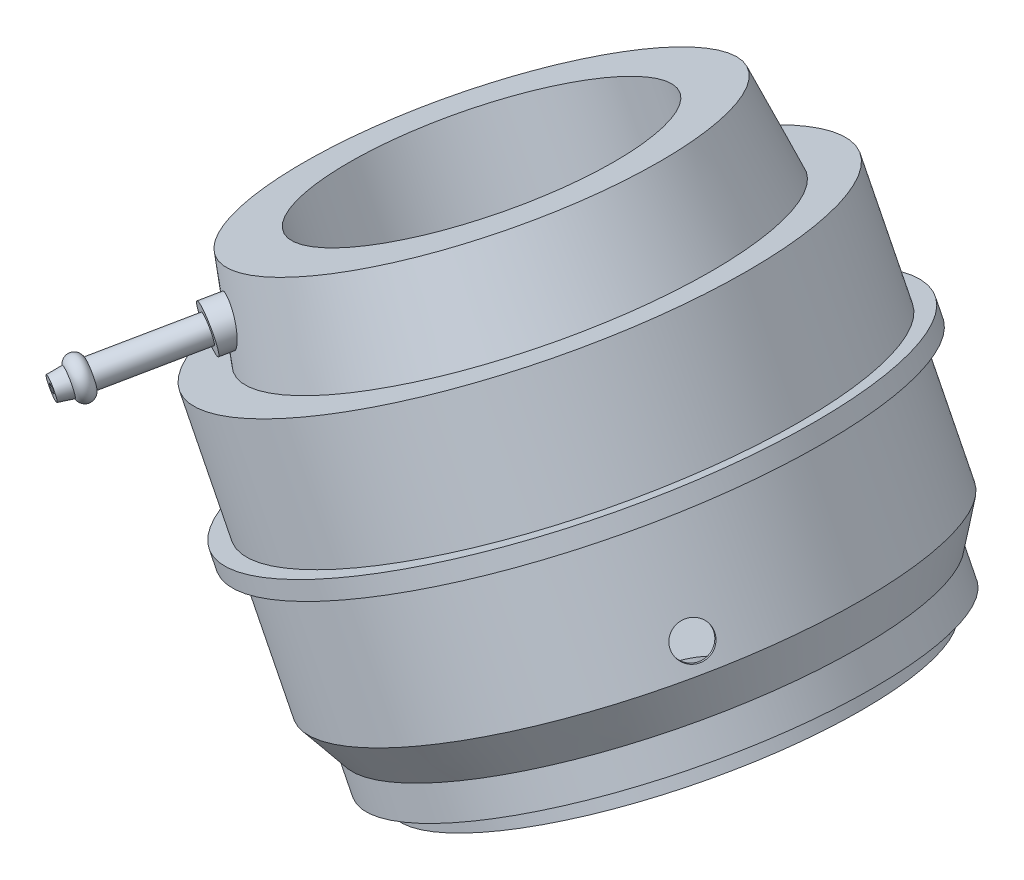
ISO-10303-21;
HEADER;
FILE_DESCRIPTION(('STEP AP214'),'2;1');
FILE_NAME('part.step','',(''),(''),'','','');
FILE_SCHEMA(('AUTOMOTIVE_DESIGN { 1 0 10303 214 1 1 1 1 }'));
ENDSEC;
DATA;
#1=APPLICATION_CONTEXT('core data for automotive mechanical design processes');
#2=APPLICATION_PROTOCOL_DEFINITION('international standard','automotive_design',2000,#1);
#3=PRODUCT_CONTEXT('',#1,'mechanical');
#4=PRODUCT('Part','Part','',(#3));
#5=PRODUCT_RELATED_PRODUCT_CATEGORY('part','',(#4));
#6=PRODUCT_DEFINITION_FORMATION('','',#4);
#7=PRODUCT_DEFINITION_CONTEXT('part definition',#1,'design');
#8=PRODUCT_DEFINITION('design','',#6,#7);
#9=PRODUCT_DEFINITION_SHAPE('','',#8);
#10=(LENGTH_UNIT() NAMED_UNIT(*) SI_UNIT(.MILLI.,.METRE.));
#11=(NAMED_UNIT(*) PLANE_ANGLE_UNIT() SI_UNIT($,.RADIAN.));
#12=(NAMED_UNIT(*) SI_UNIT($,.STERADIAN.) SOLID_ANGLE_UNIT());
#13=UNCERTAINTY_MEASURE_WITH_UNIT(LENGTH_MEASURE(1.E-05),#10,'distance_accuracy_value','');
#14=(GEOMETRIC_REPRESENTATION_CONTEXT(3) GLOBAL_UNCERTAINTY_ASSIGNED_CONTEXT((#13)) GLOBAL_UNIT_ASSIGNED_CONTEXT((#10,
#11,#12)) REPRESENTATION_CONTEXT('',''));
#15=CARTESIAN_POINT('',(0.,0.,0.));
#16=DIRECTION('',(0.,0.,1.));
#17=DIRECTION('',(1.,0.,0.));
#18=AXIS2_PLACEMENT_3D('',#15,#16,#17);
#19=CARTESIAN_POINT('',(-26.0637595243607,128.782533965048,0.));
#20=DIRECTION('',(0.449375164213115,-0.893343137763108,0.));
#21=DIRECTION('',(0.893343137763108,0.449375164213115,0.));
#22=AXIS2_PLACEMENT_3D('',#19,#20,#21);
#23=CONICAL_SURFACE('',#22,25.2632698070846,0.174532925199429);
#24=CARTESIAN_POINT('',(-30.5575111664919,137.715965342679,0.));
#25=DIRECTION('',(0.449375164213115,-0.893343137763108,0.));
#26=DIRECTION('',(0.893343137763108,0.449375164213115,0.));
#27=AXIS2_PLACEMENT_3D('',#24,#25,#26);
#28=CIRCLE('',#27,23.5);
#29=CARTESIAN_POINT('',(-9.56394742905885,148.276281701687,0.));
#30=VERTEX_POINT('',#29);
#31=EDGE_CURVE('E426',#30,#30,#28,.T.);
#32=ORIENTED_EDGE('',*,*,#31,.T.);
#33=EDGE_LOOP('',(#32));
#34=FACE_BOUND('',#33,.T.);
#35=CARTESIAN_POINT('',(-26.0637595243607,128.782533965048,0.));
#36=DIRECTION('',(0.449375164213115,-0.893343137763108,0.));
#37=DIRECTION('',(0.893343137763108,0.449375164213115,0.));
#38=AXIS2_PLACEMENT_3D('',#35,#36,#37);
#39=CIRCLE('',#38,25.2632698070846);
#40=CARTESIAN_POINT('',(-3.49499080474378,140.135219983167,0.));
#41=VERTEX_POINT('',#40);
#42=EDGE_CURVE('E423',#41,#41,#39,.T.);
#43=ORIENTED_EDGE('',*,*,#42,.F.);
#44=EDGE_LOOP('',(#43));
#45=FACE_BOUND('',#44,.T.);
#46=CARTESIAN_POINT('',(-40.8278184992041,126.333093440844,19.8752845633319));
#47=CARTESIAN_POINT('',(-40.7531509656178,126.214650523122,19.9152422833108));
#48=CARTESIAN_POINT('',(-40.6707447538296,126.103169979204,19.9617432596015));
#49=CARTESIAN_POINT('',(-40.492611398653,125.897363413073,20.0661788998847));
#50=CARTESIAN_POINT('',(-40.3968679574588,125.803058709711,20.12412758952));
#51=CARTESIAN_POINT('',(-40.1944824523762,125.634486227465,20.249391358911));
#52=CARTESIAN_POINT('',(-40.0878417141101,125.560216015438,20.3167052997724));
#53=CARTESIAN_POINT('',(-39.8663022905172,125.434106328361,20.4583339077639));
#54=CARTESIAN_POINT('',(-39.7514060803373,125.382260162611,20.5326464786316));
#55=CARTESIAN_POINT('',(-39.5173771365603,125.30325406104,20.6849432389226));
#56=CARTESIAN_POINT('',(-39.3982955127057,125.275862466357,20.7628854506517));
#57=CARTESIAN_POINT('',(-39.1580572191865,125.246196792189,20.9203559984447));
#58=CARTESIAN_POINT('',(-39.0369008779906,125.243918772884,20.9998840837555));
#59=CARTESIAN_POINT('',(-38.7997733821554,125.264632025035,21.1552449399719));
#60=CARTESIAN_POINT('',(-38.683758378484,125.286837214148,21.2311155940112));
#61=CARTESIAN_POINT('',(-38.4564259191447,125.354866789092,21.3792049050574));
#62=CARTESIAN_POINT('',(-38.3451075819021,125.400686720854,21.4514242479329));
#63=CARTESIAN_POINT('',(-38.1333785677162,125.513101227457,21.5881054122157));
#64=CARTESIAN_POINT('',(-38.0327561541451,125.579109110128,21.6527227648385));
#65=CARTESIAN_POINT('',(-37.8420085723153,125.7302582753,21.7746367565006));
#66=CARTESIAN_POINT('',(-37.7518831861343,125.815399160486,21.8319335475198));
#67=CARTESIAN_POINT('',(-37.584625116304,126.002252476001,21.937927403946));
#68=CARTESIAN_POINT('',(-37.5074983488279,126.103972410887,21.986620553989));
#69=CARTESIAN_POINT('',(-37.3683625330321,126.320941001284,22.0745189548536));
#70=CARTESIAN_POINT('',(-37.3063553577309,126.436191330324,22.1137230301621));
#71=CARTESIAN_POINT('',(-37.1976594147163,126.680164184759,22.1830731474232));
#72=CARTESIAN_POINT('',(-37.1514197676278,126.809162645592,22.2129518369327));
#73=CARTESIAN_POINT('',(-37.0778353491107,127.07437789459,22.2620338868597));
#74=CARTESIAN_POINT('',(-37.0504938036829,127.210595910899,22.2812354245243));
#75=CARTESIAN_POINT('',(-37.0149712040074,127.490892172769,22.3094555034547));
#76=CARTESIAN_POINT('',(-37.0074113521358,127.635083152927,22.3181394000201));
#77=CARTESIAN_POINT('',(-37.0136261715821,127.923254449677,22.3244706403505));
#78=CARTESIAN_POINT('',(-37.027402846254,128.067234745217,22.3221169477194));
#79=CARTESIAN_POINT('',(-37.0764768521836,128.352880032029,22.3066407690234));
#80=CARTESIAN_POINT('',(-37.1120580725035,128.494488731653,22.2933754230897));
#81=CARTESIAN_POINT('',(-37.2042192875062,128.769259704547,22.25637883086));
#82=CARTESIAN_POINT('',(-37.2607983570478,128.902422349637,22.2326480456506));
#83=CARTESIAN_POINT('',(-37.3928878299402,129.155168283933,22.1755678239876));
#84=CARTESIAN_POINT('',(-37.4682221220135,129.274863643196,22.1423074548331));
#85=CARTESIAN_POINT('',(-37.6359298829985,129.498426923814,22.0667676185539));
#86=CARTESIAN_POINT('',(-37.7283016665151,129.602296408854,22.0244890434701));
#87=CARTESIAN_POINT('',(-37.9255148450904,129.789374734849,21.9325371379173));
#88=CARTESIAN_POINT('',(-38.030110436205,129.872912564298,21.8830057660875));
#89=CARTESIAN_POINT('',(-38.2497839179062,130.019160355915,21.7769354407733));
#90=CARTESIAN_POINT('',(-38.3648611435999,130.081871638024,21.7203969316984));
#91=CARTESIAN_POINT('',(-38.6005065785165,130.184055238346,21.6020723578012));
#92=CARTESIAN_POINT('',(-38.7209973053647,130.223784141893,21.5403534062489));
#93=CARTESIAN_POINT('',(-38.9649335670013,130.280018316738,21.4123445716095));
#94=CARTESIAN_POINT('',(-39.0883790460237,130.296524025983,21.3460547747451));
#95=CARTESIAN_POINT('',(-39.3340447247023,130.30589632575,21.210537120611));
#96=CARTESIAN_POINT('',(-39.4562675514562,130.298836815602,21.1413191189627));
#97=CARTESIAN_POINT('',(-39.6962147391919,130.261508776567,21.0013608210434));
#98=CARTESIAN_POINT('',(-39.8139391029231,130.231240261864,20.9306205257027));
#99=CARTESIAN_POINT('',(-40.0414665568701,130.148384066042,20.7894099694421));
#100=CARTESIAN_POINT('',(-40.1512678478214,130.095791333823,20.7189397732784));
#101=CARTESIAN_POINT('',(-40.3597949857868,129.969781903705,20.5802661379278));
#102=CARTESIAN_POINT('',(-40.4585207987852,129.896365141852,20.5120627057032));
#103=CARTESIAN_POINT('',(-40.642204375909,129.730738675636,20.3800079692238));
#104=CARTESIAN_POINT('',(-40.727159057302,129.638524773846,20.3161576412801));
#105=CARTESIAN_POINT('',(-40.8810394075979,129.437872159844,20.1949679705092));
#106=CARTESIAN_POINT('',(-40.9499651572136,129.329433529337,20.1376285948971));
#107=CARTESIAN_POINT('',(-41.0700632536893,129.099383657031,20.0315596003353));
#108=CARTESIAN_POINT('',(-41.1212423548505,128.977777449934,19.9828267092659));
#109=CARTESIAN_POINT('',(-41.2047465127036,128.724749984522,19.8958379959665));
#110=CARTESIAN_POINT('',(-41.2370725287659,128.593329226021,19.8575816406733));
#111=CARTESIAN_POINT('',(-41.2823252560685,128.324311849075,19.7931136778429));
#112=CARTESIAN_POINT('',(-41.2952479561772,128.186713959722,19.7669045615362));
#113=CARTESIAN_POINT('',(-41.3016972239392,127.909173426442,19.7276850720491));
#114=CARTESIAN_POINT('',(-41.2952192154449,127.769230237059,19.7146778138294));
#115=CARTESIAN_POINT('',(-41.2633196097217,127.490116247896,19.7024621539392));
#116=CARTESIAN_POINT('',(-41.237790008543,127.350954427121,19.7033330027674));
#117=CARTESIAN_POINT('',(-41.1686954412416,127.078125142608,19.7191434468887));
#118=CARTESIAN_POINT('',(-41.1251484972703,126.94445233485,19.7340690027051));
#119=CARTESIAN_POINT('',(-41.0392611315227,126.730453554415,19.7700092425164));
#120=CARTESIAN_POINT('',(-41.0016180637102,126.647539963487,19.7871862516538));
#121=CARTESIAN_POINT('',(-40.9196321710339,126.486510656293,19.8271220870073));
#122=CARTESIAN_POINT('',(-40.875289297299,126.408394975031,19.8498809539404));
#123=CARTESIAN_POINT('',(-40.8278184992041,126.333093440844,19.8752845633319));
#124=B_SPLINE_CURVE_WITH_KNOTS('',3,(#46,#47,#48,#49,#50,#51,#52,#53,#54,#55,#56,#57,#58,#59,
#60,#61,#62,#63,#64,#65,#66,#67,#68,#69,#70,#71,#72,#73,#74,#75,#76,#77,#78,#79,#80,#81,#82,#83,
#84,#85,#86,#87,#88,#89,#90,#91,#92,#93,#94,#95,#96,#97,#98,#99,#100,#101,#102,#103,#104,#105,
#106,#107,#108,#109,#110,#111,#112,#113,#114,#115,#116,#117,#118,#119,#120,#121,#122,#123),
.UNSPECIFIED.,.T.,.F.,(4,2,2,2,2,2,2,2,2,2,2,2,2,2,2,2,2,2,2,2,2,2,2,2,2,2,2,2,2,2,2,2,2,2,2,2,
2,2,4),(0.,0.436476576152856,0.873491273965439,1.31045287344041,1.74728400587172,
2.17993171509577,2.61251154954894,3.03159664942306,3.45060273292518,3.85843318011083,
4.26625515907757,4.67426225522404,5.08231986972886,5.50118307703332,5.92011776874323,
6.35205855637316,6.78403990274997,7.2217686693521,7.65947815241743,8.0932231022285,
8.52692516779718,8.95305687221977,9.37916156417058,9.80041235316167,10.221655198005,
10.6415782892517,11.0615011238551,11.4815190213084,11.9015382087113,12.321651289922,
12.7417622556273,13.1617131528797,13.5816426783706,14.0016590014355,14.4217744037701,
14.8442897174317,15.2663834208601,15.5438767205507,15.8213720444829),.UNSPECIFIED.);
#125=CARTESIAN_POINT('',(-40.8278184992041,126.333093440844,19.8752845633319));
#126=VERTEX_POINT('',#125);
#127=EDGE_CURVE('E501',#126,#126,#124,.T.);
#128=ORIENTED_EDGE('',*,*,#127,.F.);
#129=EDGE_LOOP('',(#128));
#130=FACE_BOUND('',#129,.T.);
#131=ADVANCED_FACE('F378',(#34,#45,#130),#23,.T.);
#132=CARTESIAN_POINT('',(18.8737568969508,39.4482201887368,0.));
#133=DIRECTION('',(0.449375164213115,-0.893343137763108,0.));
#134=DIRECTION('',(0.893343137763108,0.449375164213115,0.));
#135=AXIS2_PLACEMENT_3D('',#132,#133,#134);
#136=CYLINDRICAL_SURFACE('',#135,5.49999999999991);
#137=CARTESIAN_POINT('',(-8.08875295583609,93.0488084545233,0.));
#138=DIRECTION('',(0.449375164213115,-0.893343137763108,0.));
#139=DIRECTION('',(0.893343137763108,0.449375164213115,0.));
#140=AXIS2_PLACEMENT_3D('',#137,#138,#139);
#141=CIRCLE('',#140,5.49999999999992);
#142=CARTESIAN_POINT('',(-3.17536569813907,95.5203718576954,0.));
#143=VERTEX_POINT('',#142);
#144=EDGE_CURVE('E11',#143,#143,#141,.T.);
#145=ORIENTED_EDGE('',*,*,#144,.T.);
#146=EDGE_LOOP('',(#145));
#147=FACE_BOUND('',#146,.T.);
#148=CARTESIAN_POINT('',(-9.21219086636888,95.282166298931,0.));
#149=DIRECTION('',(0.449375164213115,-0.893343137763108,0.));
#150=DIRECTION('',(0.893343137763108,0.449375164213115,0.));
#151=AXIS2_PLACEMENT_3D('',#148,#149,#150);
#152=CIRCLE('',#151,5.49999999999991);
#153=CARTESIAN_POINT('',(-4.29880360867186,97.7537297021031,0.));
#154=VERTEX_POINT('',#153);
#155=EDGE_CURVE('E483',#154,#154,#152,.T.);
#156=ORIENTED_EDGE('',*,*,#155,.F.);
#157=EDGE_LOOP('',(#156));
#158=FACE_BOUND('',#157,.T.);
#159=ADVANCED_FACE('F380',(#147,#158),#136,.F.);
#160=CARTESIAN_POINT('',(-3.17536569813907,95.5203718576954,0.));
#161=DIRECTION('',(0.449375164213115,-0.893343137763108,0.));
#162=DIRECTION('',(0.893343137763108,0.449375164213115,0.));
#163=AXIS2_PLACEMENT_3D('',#160,#161,#162);
#164=PLANE('',#163);
#165=CARTESIAN_POINT('',(-22.3822431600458,85.8588058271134,0.));
#166=DIRECTION('',(0.449375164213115,-0.893343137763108,0.));
#167=DIRECTION('',(0.893343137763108,0.449375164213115,0.));
#168=AXIS2_PLACEMENT_3D('',#165,#166,#167);
#169=CIRCLE('',#168,3.);
#170=CARTESIAN_POINT('',(-19.7022137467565,87.2069313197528,0.));
#171=VERTEX_POINT('',#170);
#172=EDGE_CURVE('E490',#171,#171,#169,.T.);
#173=ORIENTED_EDGE('',*,*,#172,.F.);
#174=EDGE_LOOP('',(#173));
#175=FACE_BOUND('',#174,.T.);
#176=CARTESIAN_POINT('',(6.20473724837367,100.238811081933,0.));
#177=DIRECTION('',(0.449375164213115,-0.893343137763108,0.));
#178=DIRECTION('',(0.893343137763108,0.449375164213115,0.));
#179=AXIS2_PLACEMENT_3D('',#176,#177,#178);
#180=CIRCLE('',#179,3.00000000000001);
#181=CARTESIAN_POINT('',(8.884766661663,101.586936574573,0.));
#182=VERTEX_POINT('',#181);
#183=EDGE_CURVE('E486',#182,#182,#180,.T.);
#184=ORIENTED_EDGE('',*,*,#183,.F.);
#185=EDGE_LOOP('',(#184));
#186=FACE_BOUND('',#185,.T.);
#187=CARTESIAN_POINT('',(-8.0887529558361,93.0488084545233,0.));
#188=DIRECTION('',(0.449375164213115,-0.893343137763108,0.));
#189=DIRECTION('',(0.893343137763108,0.449375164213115,0.));
#190=AXIS2_PLACEMENT_3D('',#187,#188,#189);
#191=CIRCLE('',#190,25.);
#192=CARTESIAN_POINT('',(14.2448254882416,104.283187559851,0.));
#193=VERTEX_POINT('',#192);
#194=EDGE_CURVE('E390',#193,#193,#191,.T.);
#195=ORIENTED_EDGE('',*,*,#194,.T.);
#196=EDGE_LOOP('',(#195));
#197=FACE_BOUND('',#196,.T.);
#198=ORIENTED_EDGE('',*,*,#144,.F.);
#199=EDGE_LOOP('',(#198));
#200=FACE_BOUND('',#199,.T.);
#201=ADVANCED_FACE('F582',(#175,#186,#197,#200),#164,.T.);
#202=CARTESIAN_POINT('',(18.8737568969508,39.4482201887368,0.));
#203=DIRECTION('',(0.449375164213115,-0.893343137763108,0.));
#204=DIRECTION('',(0.893343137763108,0.449375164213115,0.));
#205=AXIS2_PLACEMENT_3D('',#202,#203,#204);
#206=CYLINDRICAL_SURFACE('',#205,25.);
#207=CARTESIAN_POINT('',(-8.98750328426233,94.8354947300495,0.));
#208=DIRECTION('',(0.449375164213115,-0.893343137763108,0.));
#209=DIRECTION('',(0.893343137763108,0.449375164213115,0.));
#210=AXIS2_PLACEMENT_3D('',#207,#208,#209);
#211=CIRCLE('',#210,25.);
#212=CARTESIAN_POINT('',(13.3460751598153,106.069873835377,0.));
#213=VERTEX_POINT('',#212);
#214=EDGE_CURVE('E394',#213,#213,#211,.T.);
#215=ORIENTED_EDGE('',*,*,#214,.T.);
#216=EDGE_LOOP('',(#215));
#217=FACE_BOUND('',#216,.T.);
#218=ORIENTED_EDGE('',*,*,#194,.F.);
#219=EDGE_LOOP('',(#218));
#220=FACE_BOUND('',#219,.T.);
#221=ADVANCED_FACE('F623',(#217,#220),#206,.T.);
#222=CARTESIAN_POINT('',(13.3460751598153,106.069873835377,0.));
#223=DIRECTION('',(0.449375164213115,-0.893343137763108,0.));
#224=DIRECTION('',(0.893343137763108,0.449375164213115,0.));
#225=AXIS2_PLACEMENT_3D('',#222,#223,#224);
#226=PLANE('',#225);
#227=CARTESIAN_POINT('',(-8.98750328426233,94.8354947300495,0.));
#228=DIRECTION('',(0.449375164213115,-0.893343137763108,0.));
#229=DIRECTION('',(0.893343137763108,0.449375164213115,0.));
#230=AXIS2_PLACEMENT_3D('',#227,#228,#229);
#231=CIRCLE('',#230,27.4999999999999);
#232=CARTESIAN_POINT('',(15.5794330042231,107.19331174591,0.));
#233=VERTEX_POINT('',#232);
#234=EDGE_CURVE('E399',#233,#233,#231,.T.);
#235=ORIENTED_EDGE('',*,*,#234,.T.);
#236=EDGE_LOOP('',(#235));
#237=FACE_BOUND('',#236,.T.);
#238=ORIENTED_EDGE('',*,*,#214,.F.);
#239=EDGE_LOOP('',(#238));
#240=FACE_BOUND('',#239,.T.);
#241=ADVANCED_FACE('F619',(#237,#240),#226,.T.);
#242=CARTESIAN_POINT('',(18.8737568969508,39.4482201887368,0.));
#243=DIRECTION('',(0.449375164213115,-0.893343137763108,0.));
#244=DIRECTION('',(0.893343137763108,0.449375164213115,0.));
#245=AXIS2_PLACEMENT_3D('',#242,#243,#244);
#246=CYLINDRICAL_SURFACE('',#245,27.4999999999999);
#247=CARTESIAN_POINT('',(-10.6366530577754,98.1139505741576,0.));
#248=DIRECTION('',(0.449375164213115,-0.893343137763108,0.));
#249=DIRECTION('',(0.893343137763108,0.449375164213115,0.));
#250=AXIS2_PLACEMENT_3D('',#247,#248,#249);
#251=CIRCLE('',#250,27.4999999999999);
#252=CARTESIAN_POINT('',(13.9302832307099,110.471767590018,0.));
#253=VERTEX_POINT('',#252);
#254=EDGE_CURVE('E402',#253,#253,#251,.T.);
#255=ORIENTED_EDGE('',*,*,#254,.T.);
#256=EDGE_LOOP('',(#255));
#257=FACE_BOUND('',#256,.T.);
#258=ORIENTED_EDGE('',*,*,#234,.F.);
#259=EDGE_LOOP('',(#258));
#260=FACE_BOUND('',#259,.T.);
#261=ADVANCED_FACE('F615',(#257,#260),#246,.T.);
#262=CARTESIAN_POINT('',(-10.6366530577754,98.1139505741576,0.));
#263=DIRECTION('',(-0.449375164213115,0.893343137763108,0.));
#264=DIRECTION('',(-0.893343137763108,-0.449375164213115,0.));
#265=AXIS2_PLACEMENT_3D('',#262,#263,#264);
#266=CONICAL_SURFACE('',#265,27.4999999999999,0.523598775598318);
#267=CARTESIAN_POINT('',(-12.5825045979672,101.982239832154,0.));
#268=DIRECTION('',(0.449375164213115,-0.893343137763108,0.));
#269=DIRECTION('',(0.893343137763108,0.449375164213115,0.));
#270=AXIS2_PLACEMENT_3D('',#267,#268,#269);
#271=CIRCLE('',#270,30.);
#272=CARTESIAN_POINT('',(14.217789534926,115.463494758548,0.));
#273=VERTEX_POINT('',#272);
#274=EDGE_CURVE('E405',#273,#273,#271,.T.);
#275=ORIENTED_EDGE('',*,*,#274,.T.);
#276=EDGE_LOOP('',(#275));
#277=FACE_BOUND('',#276,.T.);
#278=ORIENTED_EDGE('',*,*,#254,.F.);
#279=EDGE_LOOP('',(#278));
#280=FACE_BOUND('',#279,.T.);
#281=ADVANCED_FACE('F611',(#277,#280),#266,.T.);
#282=CARTESIAN_POINT('',(18.8737568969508,39.4482201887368,0.));
#283=DIRECTION('',(0.449375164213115,-0.893343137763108,0.));
#284=DIRECTION('',(0.893343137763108,0.449375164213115,0.));
#285=AXIS2_PLACEMENT_3D('',#282,#283,#284);
#286=CYLINDRICAL_SURFACE('',#285,30.);
#287=CARTESIAN_POINT('',(8.14496519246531,116.312951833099,16.6483533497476));
#288=CARTESIAN_POINT('',(8.18024296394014,116.208985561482,16.6711468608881));
#289=CARTESIAN_POINT('',(8.22110935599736,116.105156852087,16.6863015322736));
#290=CARTESIAN_POINT('',(8.31294917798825,115.900823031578,16.7009016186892));
#291=CARTESIAN_POINT('',(8.36393404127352,115.80032183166,16.700329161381));
#292=CARTESIAN_POINT('',(8.47451475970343,115.605621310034,16.6834643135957));
#293=CARTESIAN_POINT('',(8.53410657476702,115.511419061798,16.6671792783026));
#294=CARTESIAN_POINT('',(8.66012228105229,115.331925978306,16.6193147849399));
#295=CARTESIAN_POINT('',(8.72654462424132,115.246633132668,16.5877387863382));
#296=CARTESIAN_POINT('',(8.86423801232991,115.087208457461,16.5100706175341));
#297=CARTESIAN_POINT('',(8.93551207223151,115.013083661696,16.4639693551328));
#298=CARTESIAN_POINT('',(9.08064978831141,114.87803638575,16.3584259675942));
#299=CARTESIAN_POINT('',(9.15451357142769,114.817114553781,16.2989831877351));
#300=CARTESIAN_POINT('',(9.30265151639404,114.70996258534,16.1681496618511));
#301=CARTESIAN_POINT('',(9.37692619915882,114.663761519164,16.0967356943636));
#302=CARTESIAN_POINT('',(9.52339543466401,114.587399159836,15.9438995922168));
#303=CARTESIAN_POINT('',(9.59558998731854,114.557237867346,15.8624774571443));
#304=CARTESIAN_POINT('',(9.73564961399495,114.513699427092,15.6917608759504));
#305=CARTESIAN_POINT('',(9.8035135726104,114.500326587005,15.6024644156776));
#306=CARTESIAN_POINT('',(9.93278610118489,114.49068276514,15.418440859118));
#307=CARTESIAN_POINT('',(9.99419476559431,114.494411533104,15.3237138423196));
#308=CARTESIAN_POINT('',(10.1085927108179,114.518796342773,15.1316397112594));
#309=CARTESIAN_POINT('',(10.1615974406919,114.539420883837,15.0342977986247));
#310=CARTESIAN_POINT('',(10.2577924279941,114.596959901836,14.8395796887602));
#311=CARTESIAN_POINT('',(10.3009827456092,114.633874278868,14.7422034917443));
#312=CARTESIAN_POINT('',(10.3763418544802,114.722920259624,14.5503271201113));
#313=CARTESIAN_POINT('',(10.4085224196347,114.775035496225,14.4558239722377));
#314=CARTESIAN_POINT('',(10.4611558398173,114.8930830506,14.2723433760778));
#315=CARTESIAN_POINT('',(10.4816085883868,114.959015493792,14.1833659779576));
#316=CARTESIAN_POINT('',(10.510430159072,115.103027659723,14.0134523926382));
#317=CARTESIAN_POINT('',(10.5187822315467,115.181124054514,13.9325274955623));
#318=CARTESIAN_POINT('',(10.5233521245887,115.347309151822,13.7812900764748));
#319=CARTESIAN_POINT('',(10.5195698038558,115.435397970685,13.7109776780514));
#320=CARTESIAN_POINT('',(10.5002079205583,115.61936549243,13.5829995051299));
#321=CARTESIAN_POINT('',(10.4846084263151,115.715257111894,13.5253553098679));
#322=CARTESIAN_POINT('',(10.4422596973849,115.912104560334,13.4246541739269));
#323=CARTESIAN_POINT('',(10.4155105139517,116.01306036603,13.3815971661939));
#324=CARTESIAN_POINT('',(10.3518286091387,116.217203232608,13.3114481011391));
#325=CARTESIAN_POINT('',(10.3149023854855,116.320388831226,13.2843458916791));
#326=CARTESIAN_POINT('',(10.2320339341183,116.526181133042,13.2469269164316));
#327=CARTESIAN_POINT('',(10.1860918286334,116.628787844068,13.2366099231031));
#328=CARTESIAN_POINT('',(10.086649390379,116.830321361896,13.2330949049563));
#329=CARTESIAN_POINT('',(10.0331641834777,116.929255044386,13.2398630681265));
#330=CARTESIAN_POINT('',(9.92005495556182,117.120829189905,13.2702306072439));
#331=CARTESIAN_POINT('',(9.86043094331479,117.213469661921,13.2938299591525));
#332=CARTESIAN_POINT('',(9.73663942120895,117.389756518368,13.3571027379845));
#333=CARTESIAN_POINT('',(9.67247295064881,117.473404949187,13.3967724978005));
#334=CARTESIAN_POINT('',(9.54122009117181,117.629285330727,13.4909406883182));
#335=CARTESIAN_POINT('',(9.4741336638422,117.701517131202,13.5454393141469));
#336=CARTESIAN_POINT('',(9.33857945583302,117.832543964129,13.6676936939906));
#337=CARTESIAN_POINT('',(9.27010931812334,117.891313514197,13.7354741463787));
#338=CARTESIAN_POINT('',(9.1335959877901,117.993459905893,13.8821526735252));
#339=CARTESIAN_POINT('',(9.06555279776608,118.036836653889,13.9610508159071));
#340=CARTESIAN_POINT('',(8.9315045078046,118.106883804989,14.1276721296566));
#341=CARTESIAN_POINT('',(8.86550163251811,118.133536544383,14.2154045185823));
#342=CARTESIAN_POINT('',(8.73727725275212,118.169193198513,14.3970050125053));
#343=CARTESIAN_POINT('',(8.67505571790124,118.178197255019,14.4908730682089));
#344=CARTESIAN_POINT('',(8.55610185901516,118.178215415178,14.6818436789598));
#345=CARTESIAN_POINT('',(8.4993619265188,118.16925484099,14.7789414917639));
#346=CARTESIAN_POINT('',(8.3928141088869,118.133605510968,14.9736840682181));
#347=CARTESIAN_POINT('',(8.34300615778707,118.106916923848,15.0713288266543));
#348=CARTESIAN_POINT('',(8.25182295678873,118.036634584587,15.2642274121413));
#349=CARTESIAN_POINT('',(8.21043391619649,117.993068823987,15.3594849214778));
#350=CARTESIAN_POINT('',(8.13724410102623,117.890317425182,15.5451292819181));
#351=CARTESIAN_POINT('',(8.10544301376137,117.83113229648,15.6355162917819));
#352=CARTESIAN_POINT('',(8.05246376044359,117.698866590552,15.809021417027));
#353=CARTESIAN_POINT('',(8.03129161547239,117.62577816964,15.8921353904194));
#354=CARTESIAN_POINT('',(8.00039800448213,117.46788015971,16.0488536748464));
#355=CARTESIAN_POINT('',(7.99067941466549,117.383067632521,16.1224555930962));
#356=CARTESIAN_POINT('',(7.98320306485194,117.204042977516,16.2583723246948));
#357=CARTESIAN_POINT('',(7.98547439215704,117.109808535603,16.3206593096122));
#358=CARTESIAN_POINT('',(8.0022334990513,116.914966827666,16.4320707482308));
#359=CARTESIAN_POINT('',(8.0167071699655,116.814367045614,16.4812103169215));
#360=CARTESIAN_POINT('',(8.05029402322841,116.64645336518,16.5500886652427));
#361=CARTESIAN_POINT('',(8.06589001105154,116.580119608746,16.5740545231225));
#362=CARTESIAN_POINT('',(8.10187422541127,116.446822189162,16.6158525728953));
#363=CARTESIAN_POINT('',(8.12226245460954,116.379858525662,16.6336847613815));
#364=CARTESIAN_POINT('',(8.14496519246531,116.312951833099,16.6483533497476));
#365=B_SPLINE_CURVE_WITH_KNOTS('',3,(#287,#288,#289,#290,#291,#292,#293,#294,#295,#296,#297,
#298,#299,#300,#301,#302,#303,#304,#305,#306,#307,#308,#309,#310,#311,#312,#313,#314,#315,#316,
#317,#318,#319,#320,#321,#322,#323,#324,#325,#326,#327,#328,#329,#330,#331,#332,#333,#334,#335,
#336,#337,#338,#339,#340,#341,#342,#343,#344,#345,#346,#347,#348,#349,#350,#351,#352,#353,#354,
#355,#356,#357,#358,#359,#360,#361,#362,#363,#364),.UNSPECIFIED.,.T.,.F.,(4,2,2,2,2,2,2,2,2,2,2,
2,2,2,2,2,2,2,2,2,2,2,2,2,2,2,2,2,2,2,2,2,2,2,2,2,2,2,4),(0.,0.336126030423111,
0.672634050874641,1.00898462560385,1.34525913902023,1.68174456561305,2.0182465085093,
2.35540890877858,2.69257132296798,3.02982023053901,3.36706420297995,3.70368084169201,
4.04029541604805,4.37654887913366,4.71280539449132,5.04952690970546,5.38625234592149,
5.72354699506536,6.06084009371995,6.3979183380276,6.73499201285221,7.0713991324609,
7.40780577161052,7.7441356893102,8.08047003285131,8.4174358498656,8.75440371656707,
9.09172688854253,9.42904735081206,9.76589267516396,10.1027347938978,10.4390206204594,
10.7752954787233,11.1117606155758,11.4483102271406,11.7856766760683,12.1226535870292,
12.3389647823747,12.5552760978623),.UNSPECIFIED.);
#366=CARTESIAN_POINT('',(8.14496519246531,116.312951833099,16.6483533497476));
#367=VERTEX_POINT('',#366);
#368=EDGE_CURVE('E548',#367,#367,#365,.T.);
#369=ORIENTED_EDGE('',*,*,#368,.F.);
#370=EDGE_LOOP('',(#369));
#371=FACE_BOUND('',#370,.T.);
#372=CARTESIAN_POINT('',(-18.9861006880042,114.712379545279,0.));
#373=DIRECTION('',(0.449375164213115,-0.893343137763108,0.));
#374=DIRECTION('',(0.893343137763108,0.449375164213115,0.));
#375=AXIS2_PLACEMENT_3D('',#372,#373,#374);
#376=CIRCLE('',#375,30.);
#377=CARTESIAN_POINT('',(7.81419344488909,128.193634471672,0.));
#378=VERTEX_POINT('',#377);
#379=EDGE_CURVE('E408',#378,#378,#376,.T.);
#380=ORIENTED_EDGE('',*,*,#379,.T.);
#381=EDGE_LOOP('',(#380));
#382=FACE_BOUND('',#381,.T.);
#383=ORIENTED_EDGE('',*,*,#274,.F.);
#384=EDGE_LOOP('',(#383));
#385=FACE_BOUND('',#384,.T.);
#386=ADVANCED_FACE('F606',(#371,#382,#385),#286,.T.);
#387=CARTESIAN_POINT('',(7.81419344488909,128.193634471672,0.));
#388=DIRECTION('',(0.449375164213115,-0.893343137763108,0.));
#389=DIRECTION('',(0.893343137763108,0.449375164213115,0.));
#390=AXIS2_PLACEMENT_3D('',#387,#388,#389);
#391=PLANE('',#390);
#392=CARTESIAN_POINT('',(-18.9861006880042,114.712379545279,0.));
#393=DIRECTION('',(0.449375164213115,-0.893343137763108,0.));
#394=DIRECTION('',(0.893343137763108,0.449375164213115,0.));
#395=AXIS2_PLACEMENT_3D('',#392,#393,#394);
#396=CIRCLE('',#395,32.);
#397=CARTESIAN_POINT('',(9.60087972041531,129.092384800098,0.));
#398=VERTEX_POINT('',#397);
#399=EDGE_CURVE('E411',#398,#398,#396,.T.);
#400=ORIENTED_EDGE('',*,*,#399,.T.);
#401=EDGE_LOOP('',(#400));
#402=FACE_BOUND('',#401,.T.);
#403=ORIENTED_EDGE('',*,*,#379,.F.);
#404=EDGE_LOOP('',(#403));
#405=FACE_BOUND('',#404,.T.);
#406=ADVANCED_FACE('F603',(#402,#405),#391,.T.);
#407=CARTESIAN_POINT('',(18.8737568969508,39.4482201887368,0.));
#408=DIRECTION('',(0.449375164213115,-0.893343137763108,0.));
#409=DIRECTION('',(0.893343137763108,0.449375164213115,0.));
#410=AXIS2_PLACEMENT_3D('',#407,#408,#409);
#411=CYLINDRICAL_SURFACE('',#410,32.);
#412=CARTESIAN_POINT('',(-19.8848510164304,116.499065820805,0.));
#413=DIRECTION('',(0.449375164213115,-0.893343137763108,0.));
#414=DIRECTION('',(0.893343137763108,0.449375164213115,0.));
#415=AXIS2_PLACEMENT_3D('',#412,#413,#414);
#416=CIRCLE('',#415,32.);
#417=CARTESIAN_POINT('',(8.70212939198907,130.879071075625,0.));
#418=VERTEX_POINT('',#417);
#419=EDGE_CURVE('E414',#418,#418,#416,.T.);
#420=ORIENTED_EDGE('',*,*,#419,.T.);
#421=EDGE_LOOP('',(#420));
#422=FACE_BOUND('',#421,.T.);
#423=ORIENTED_EDGE('',*,*,#399,.F.);
#424=EDGE_LOOP('',(#423));
#425=FACE_BOUND('',#424,.T.);
#426=ADVANCED_FACE('F599',(#422,#425),#411,.T.);
#427=CARTESIAN_POINT('',(8.70212939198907,130.879071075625,0.));
#428=DIRECTION('',(-0.449375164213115,0.893343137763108,0.));
#429=DIRECTION('',(-0.893343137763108,-0.449375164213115,0.));
#430=AXIS2_PLACEMENT_3D('',#427,#428,#429);
#431=PLANE('',#430);
#432=CARTESIAN_POINT('',(-19.8848510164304,116.499065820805,0.));
#433=DIRECTION('',(0.449375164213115,-0.893343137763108,0.));
#434=DIRECTION('',(0.893343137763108,0.449375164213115,0.));
#435=AXIS2_PLACEMENT_3D('',#432,#433,#434);
#436=CIRCLE('',#435,30.);
#437=CARTESIAN_POINT('',(6.91544311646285,129.980320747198,0.));
#438=VERTEX_POINT('',#437);
#439=EDGE_CURVE('E417',#438,#438,#436,.T.);
#440=ORIENTED_EDGE('',*,*,#439,.T.);
#441=EDGE_LOOP('',(#440));
#442=FACE_BOUND('',#441,.T.);
#443=ORIENTED_EDGE('',*,*,#419,.F.);
#444=EDGE_LOOP('',(#443));
#445=FACE_BOUND('',#444,.T.);
#446=ADVANCED_FACE('F595',(#442,#445),#431,.T.);
#447=CARTESIAN_POINT('',(18.8737568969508,39.4482201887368,0.));
#448=DIRECTION('',(0.449375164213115,-0.893343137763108,0.));
#449=DIRECTION('',(0.893343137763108,0.449375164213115,0.));
#450=AXIS2_PLACEMENT_3D('',#447,#448,#449);
#451=CYLINDRICAL_SURFACE('',#450,30.);
#452=CARTESIAN_POINT('',(-26.0637595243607,128.782533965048,0.));
#453=DIRECTION('',(0.449375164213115,-0.893343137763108,0.));
#454=DIRECTION('',(0.893343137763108,0.449375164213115,0.));
#455=AXIS2_PLACEMENT_3D('',#452,#453,#454);
#456=CIRCLE('',#455,30.);
#457=CARTESIAN_POINT('',(0.736534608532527,142.263788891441,0.));
#458=VERTEX_POINT('',#457);
#459=EDGE_CURVE('E420',#458,#458,#456,.T.);
#460=ORIENTED_EDGE('',*,*,#459,.T.);
#461=EDGE_LOOP('',(#460));
#462=FACE_BOUND('',#461,.T.);
#463=ORIENTED_EDGE('',*,*,#439,.F.);
#464=EDGE_LOOP('',(#463));
#465=FACE_BOUND('',#464,.T.);
#466=ADVANCED_FACE('F591',(#462,#465),#451,.T.);
#467=CARTESIAN_POINT('',(0.736534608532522,142.263788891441,0.));
#468=DIRECTION('',(-0.449375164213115,0.893343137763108,0.));
#469=DIRECTION('',(-0.893343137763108,-0.449375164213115,0.));
#470=AXIS2_PLACEMENT_3D('',#467,#468,#469);
#471=PLANE('',#470);
#472=ORIENTED_EDGE('',*,*,#42,.T.);
#473=EDGE_LOOP('',(#472));
#474=FACE_BOUND('',#473,.T.);
#475=ORIENTED_EDGE('',*,*,#459,.F.);
#476=EDGE_LOOP('',(#475));
#477=FACE_BOUND('',#476,.T.);
#478=ADVANCED_FACE('F588',(#474,#477),#471,.T.);
#479=CARTESIAN_POINT('',(-9.56394742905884,148.276281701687,0.));
#480=DIRECTION('',(-0.449375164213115,0.893343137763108,0.));
#481=DIRECTION('',(-0.893343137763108,-0.449375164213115,0.));
#482=AXIS2_PLACEMENT_3D('',#479,#480,#481);
#483=PLANE('',#482);
#484=CARTESIAN_POINT('',(-30.5575111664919,137.715965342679,0.));
#485=DIRECTION('',(0.449375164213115,-0.893343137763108,0.));
#486=DIRECTION('',(0.893343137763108,0.449375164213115,0.));
#487=AXIS2_PLACEMENT_3D('',#484,#485,#486);
#488=CIRCLE('',#487,17.5);
#489=CARTESIAN_POINT('',(-14.9240062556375,145.580030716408,0.));
#490=VERTEX_POINT('',#489);
#491=EDGE_CURVE('E429',#490,#490,#488,.T.);
#492=ORIENTED_EDGE('',*,*,#491,.T.);
#493=EDGE_LOOP('',(#492));
#494=FACE_BOUND('',#493,.T.);
#495=ORIENTED_EDGE('',*,*,#31,.F.);
#496=EDGE_LOOP('',(#495));
#497=FACE_BOUND('',#496,.T.);
#498=ADVANCED_FACE('F586',(#494,#497),#483,.T.);
#499=CARTESIAN_POINT('',(18.8737568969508,39.4482201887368,0.));
#500=DIRECTION('',(0.449375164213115,-0.893343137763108,0.));
#501=DIRECTION('',(0.893343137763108,0.449375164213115,0.));
#502=AXIS2_PLACEMENT_3D('',#499,#500,#501);
#503=CYLINDRICAL_SURFACE('',#502,17.5);
#504=CARTESIAN_POINT('',(-23.8168837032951,124.315818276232,0.));
#505=DIRECTION('',(0.449375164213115,-0.893343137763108,0.));
#506=DIRECTION('',(0.893343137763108,0.449375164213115,0.));
#507=AXIS2_PLACEMENT_3D('',#504,#505,#506);
#508=CIRCLE('',#507,17.5);
#509=CARTESIAN_POINT('',(-8.18337879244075,132.179883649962,0.));
#510=VERTEX_POINT('',#509);
#511=EDGE_CURVE('E432',#510,#510,#508,.T.);
#512=ORIENTED_EDGE('',*,*,#511,.T.);
#513=EDGE_LOOP('',(#512));
#514=FACE_BOUND('',#513,.T.);
#515=ORIENTED_EDGE('',*,*,#491,.F.);
#516=EDGE_LOOP('',(#515));
#517=FACE_BOUND('',#516,.T.);
#518=ADVANCED_FACE('F716',(#514,#517),#503,.F.);
#519=CARTESIAN_POINT('',(-8.18337879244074,132.179883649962,0.));
#520=DIRECTION('',(-0.449375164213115,0.893343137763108,0.));
#521=DIRECTION('',(-0.893343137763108,-0.449375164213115,0.));
#522=AXIS2_PLACEMENT_3D('',#519,#520,#521);
#523=PLANE('',#522);
#524=CARTESIAN_POINT('',(-23.8168837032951,124.315818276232,0.));
#525=DIRECTION('',(0.449375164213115,-0.893343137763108,0.));
#526=DIRECTION('',(0.893343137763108,0.449375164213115,0.));
#527=AXIS2_PLACEMENT_3D('',#524,#525,#526);
#528=CIRCLE('',#527,5.61880215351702);
#529=CARTESIAN_POINT('',(-18.7973653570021,126.84076841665,0.));
#530=VERTEX_POINT('',#529);
#531=EDGE_CURVE('E435',#530,#530,#528,.T.);
#532=ORIENTED_EDGE('',*,*,#531,.T.);
#533=EDGE_LOOP('',(#532));
#534=FACE_BOUND('',#533,.T.);
#535=ORIENTED_EDGE('',*,*,#511,.F.);
#536=EDGE_LOOP('',(#535));
#537=FACE_BOUND('',#536,.T.);
#538=ADVANCED_FACE('F713',(#534,#537),#523,.T.);
#539=CARTESIAN_POINT('',(18.8737568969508,39.4482201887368,0.));
#540=DIRECTION('',(0.449375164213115,-0.893343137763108,0.));
#541=DIRECTION('',(0.893343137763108,0.449375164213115,0.));
#542=AXIS2_PLACEMENT_3D('',#539,#540,#541);
#543=CYLINDRICAL_SURFACE('',#542,5.61880215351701);
#544=CARTESIAN_POINT('',(-26.0637595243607,128.782533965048,0.));
#545=DIRECTION('',(0.449375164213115,-0.893343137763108,0.));
#546=DIRECTION('',(0.893343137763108,0.449375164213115,0.));
#547=AXIS2_PLACEMENT_3D('',#544,#545,#546);
#548=CIRCLE('',#547,5.61880215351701);
#549=CARTESIAN_POINT('',(-21.0442411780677,131.307484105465,0.));
#550=VERTEX_POINT('',#549);
#551=EDGE_CURVE('E438',#550,#550,#548,.T.);
#552=ORIENTED_EDGE('',*,*,#551,.T.);
#553=EDGE_LOOP('',(#552));
#554=FACE_BOUND('',#553,.T.);
#555=ORIENTED_EDGE('',*,*,#531,.F.);
#556=EDGE_LOOP('',(#555));
#557=FACE_BOUND('',#556,.T.);
#558=ADVANCED_FACE('F709',(#554,#557),#543,.T.);
#559=CARTESIAN_POINT('',(-21.0442411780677,131.307484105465,0.));
#560=DIRECTION('',(-0.449375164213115,0.893343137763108,0.));
#561=DIRECTION('',(-0.893343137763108,-0.449375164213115,0.));
#562=AXIS2_PLACEMENT_3D('',#559,#560,#561);
#563=PLANE('',#562);
#564=ORIENTED_EDGE('',*,*,#551,.F.);
#565=EDGE_LOOP('',(#564));
#566=FACE_BOUND('',#565,.T.);
#567=ADVANCED_FACE('F705',(#566),#563,.T.);
#568=CARTESIAN_POINT('',(-21.2662251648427,130.636124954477,0.));
#569=DIRECTION('',(0.449375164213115,-0.893343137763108,0.));
#570=DIRECTION('',(0.893343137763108,0.449375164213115,0.));
#571=AXIS2_PLACEMENT_3D('',#568,#569,#570);
#572=PLANE('',#571);
#573=CARTESIAN_POINT('',(-25.8390719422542,128.335862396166,0.));
#574=DIRECTION('',(0.449375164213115,-0.893343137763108,0.));
#575=DIRECTION('',(0.893343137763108,0.449375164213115,0.));
#576=AXIS2_PLACEMENT_3D('',#573,#574,#575);
#577=CIRCLE('',#576,5.11880215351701);
#578=CARTESIAN_POINT('',(-21.2662251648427,130.636124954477,0.));
#579=VERTEX_POINT('',#578);
#580=EDGE_CURVE('E441',#579,#579,#577,.T.);
#581=ORIENTED_EDGE('',*,*,#580,.T.);
#582=EDGE_LOOP('',(#581));
#583=FACE_BOUND('',#582,.T.);
#584=ADVANCED_FACE('F701',(#583),#572,.T.);
#585=CARTESIAN_POINT('',(18.8737568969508,39.4482201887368,0.));
#586=DIRECTION('',(0.449375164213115,-0.893343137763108,0.));
#587=DIRECTION('',(0.893343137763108,0.449375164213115,0.));
#588=AXIS2_PLACEMENT_3D('',#585,#586,#587);
#589=CYLINDRICAL_SURFACE('',#588,5.11880215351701);
#590=CARTESIAN_POINT('',(-23.5921961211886,123.86914670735,0.));
#591=DIRECTION('',(0.449375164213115,-0.893343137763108,0.));
#592=DIRECTION('',(0.893343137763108,0.449375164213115,0.));
#593=AXIS2_PLACEMENT_3D('',#590,#591,#592);
#594=CIRCLE('',#593,5.118802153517);
#595=CARTESIAN_POINT('',(-19.0193493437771,126.169409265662,0.));
#596=VERTEX_POINT('',#595);
#597=EDGE_CURVE('E444',#596,#596,#594,.T.);
#598=ORIENTED_EDGE('',*,*,#597,.T.);
#599=EDGE_LOOP('',(#598));
#600=FACE_BOUND('',#599,.T.);
#601=ORIENTED_EDGE('',*,*,#580,.F.);
#602=EDGE_LOOP('',(#601));
#603=FACE_BOUND('',#602,.T.);
#604=ADVANCED_FACE('F697',(#600,#603),#589,.F.);
#605=CARTESIAN_POINT('',(-7.51201964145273,131.957899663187,0.));
#606=DIRECTION('',(0.449375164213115,-0.893343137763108,0.));
#607=DIRECTION('',(0.893343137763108,0.449375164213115,0.));
#608=AXIS2_PLACEMENT_3D('',#605,#606,#607);
#609=PLANE('',#608);
#610=CARTESIAN_POINT('',(-23.5921961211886,123.869146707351,0.));
#611=DIRECTION('',(0.449375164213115,-0.893343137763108,0.));
#612=DIRECTION('',(0.893343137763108,0.449375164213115,0.));
#613=AXIS2_PLACEMENT_3D('',#610,#611,#612);
#614=CIRCLE('',#613,17.9999999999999);
#615=CARTESIAN_POINT('',(-7.51201964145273,131.957899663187,0.));
#616=VERTEX_POINT('',#615);
#617=EDGE_CURVE('E447',#616,#616,#614,.T.);
#618=ORIENTED_EDGE('',*,*,#617,.T.);
#619=EDGE_LOOP('',(#618));
#620=FACE_BOUND('',#619,.T.);
#621=ORIENTED_EDGE('',*,*,#597,.F.);
#622=EDGE_LOOP('',(#621));
#623=FACE_BOUND('',#622,.T.);
#624=ADVANCED_FACE('F693',(#620,#623),#609,.T.);
#625=CARTESIAN_POINT('',(18.8737568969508,39.4482201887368,0.));
#626=DIRECTION('',(0.449375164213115,-0.893343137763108,0.));
#627=DIRECTION('',(0.893343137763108,0.449375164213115,0.));
#628=AXIS2_PLACEMENT_3D('',#625,#626,#627);
#629=CYLINDRICAL_SURFACE('',#628,17.9999999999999);
#630=CARTESIAN_POINT('',(-30.3328235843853,137.269293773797,0.));
#631=DIRECTION('',(0.449375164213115,-0.893343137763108,0.));
#632=DIRECTION('',(0.893343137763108,0.449375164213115,0.));
#633=AXIS2_PLACEMENT_3D('',#630,#631,#632);
#634=CIRCLE('',#633,17.9999999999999);
#635=CARTESIAN_POINT('',(-14.2526471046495,145.358046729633,0.));
#636=VERTEX_POINT('',#635);
#637=EDGE_CURVE('E450',#636,#636,#634,.T.);
#638=ORIENTED_EDGE('',*,*,#637,.T.);
#639=EDGE_LOOP('',(#638));
#640=FACE_BOUND('',#639,.T.);
#641=ORIENTED_EDGE('',*,*,#617,.F.);
#642=EDGE_LOOP('',(#641));
#643=FACE_BOUND('',#642,.T.);
#644=ADVANCED_FACE('F689',(#640,#643),#629,.T.);
#645=CARTESIAN_POINT('',(-9.7140617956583,147.64107486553,0.));
#646=DIRECTION('',(0.449375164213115,-0.893343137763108,0.));
#647=DIRECTION('',(0.893343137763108,0.449375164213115,0.));
#648=AXIS2_PLACEMENT_3D('',#645,#646,#647);
#649=PLANE('',#648);
#650=CARTESIAN_POINT('',(-30.3328235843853,137.269293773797,0.));
#651=DIRECTION('',(0.449375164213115,-0.893343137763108,0.));
#652=DIRECTION('',(0.893343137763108,0.449375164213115,0.));
#653=AXIS2_PLACEMENT_3D('',#650,#651,#652);
#654=CIRCLE('',#653,23.0804501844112);
#655=CARTESIAN_POINT('',(-9.71406179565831,147.64107486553,0.));
#656=VERTEX_POINT('',#655);
#657=EDGE_CURVE('E453',#656,#656,#654,.T.);
#658=ORIENTED_EDGE('',*,*,#657,.T.);
#659=EDGE_LOOP('',(#658));
#660=FACE_BOUND('',#659,.T.);
#661=ORIENTED_EDGE('',*,*,#637,.F.);
#662=EDGE_LOOP('',(#661));
#663=FACE_BOUND('',#662,.T.);
#664=ADVANCED_FACE('F685',(#660,#663),#649,.T.);
#665=CARTESIAN_POINT('',(-30.3328235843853,137.269293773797,0.));
#666=DIRECTION('',(0.449375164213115,-0.893343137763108,0.));
#667=DIRECTION('',(0.893343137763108,0.449375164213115,0.));
#668=AXIS2_PLACEMENT_3D('',#665,#666,#667);
#669=CONICAL_SURFACE('',#668,23.0804501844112,0.174532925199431);
#670=CARTESIAN_POINT('',(-39.123912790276,127.422245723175,20.5456167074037));
#671=CARTESIAN_POINT('',(-39.1017375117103,127.410977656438,20.5585441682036));
#672=CARTESIAN_POINT('',(-39.0788197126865,127.401835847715,20.5720906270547));
#673=CARTESIAN_POINT('',(-39.0321227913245,127.388115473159,20.60002821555));
#674=CARTESIAN_POINT('',(-39.0083428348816,127.383541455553,20.6144201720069));
#675=CARTESIAN_POINT('',(-38.9605887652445,127.379139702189,20.6436237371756));
#676=CARTESIAN_POINT('',(-38.9366146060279,127.379313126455,20.65843544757));
#677=CARTESIAN_POINT('',(-38.8891712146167,127.38444107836,20.6880289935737));
#678=CARTESIAN_POINT('',(-38.8657018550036,127.389394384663,20.7028108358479));
#679=CARTESIAN_POINT('',(-38.8202013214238,127.403875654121,20.7317442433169));
#680=CARTESIAN_POINT('',(-38.7981570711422,127.413352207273,20.7459009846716));
#681=CARTESIAN_POINT('',(-38.755860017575,127.436590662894,20.7733467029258));
#682=CARTESIAN_POINT('',(-38.7356071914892,127.450352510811,20.7866356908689));
#683=CARTESIAN_POINT('',(-38.6975860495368,127.481662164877,20.8118958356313));
#684=CARTESIAN_POINT('',(-38.679803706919,127.499187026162,20.8238743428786));
#685=CARTESIAN_POINT('',(-38.6470738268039,127.537556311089,20.8462850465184));
#686=CARTESIAN_POINT('',(-38.6321263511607,127.558400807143,20.85671720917));
#687=CARTESIAN_POINT('',(-38.605369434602,127.602968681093,20.8758435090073));
#688=CARTESIAN_POINT('',(-38.5935837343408,127.626711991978,20.8845243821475));
#689=CARTESIAN_POINT('',(-38.5736015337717,127.676274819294,20.8998480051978));
#690=CARTESIAN_POINT('',(-38.5654053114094,127.702094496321,20.9064905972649));
#691=CARTESIAN_POINT('',(-38.5527021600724,127.755523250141,20.9176856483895));
#692=CARTESIAN_POINT('',(-38.548257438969,127.783154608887,20.9222023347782));
#693=CARTESIAN_POINT('',(-38.5433880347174,127.83904756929,20.9288964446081));
#694=CARTESIAN_POINT('',(-38.5429637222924,127.867309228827,20.9310736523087));
#695=CARTESIAN_POINT('',(-38.5461610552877,127.924156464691,20.9330751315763));
#696=CARTESIAN_POINT('',(-38.5498496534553,127.952739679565,20.9328599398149));
#697=CARTESIAN_POINT('',(-38.5612728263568,128.008961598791,20.9300063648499));
#698=CARTESIAN_POINT('',(-38.5690076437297,128.036600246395,20.9273678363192));
#699=CARTESIAN_POINT('',(-38.5883967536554,128.090400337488,20.919712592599));
#700=CARTESIAN_POINT('',(-38.6000850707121,128.116546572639,20.9146750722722));
#701=CARTESIAN_POINT('',(-38.6270405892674,128.166345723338,20.9023488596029));
#702=CARTESIAN_POINT('',(-38.6423078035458,128.189998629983,20.8950601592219));
#703=CARTESIAN_POINT('',(-38.6759619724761,128.234078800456,20.8784366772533));
#704=CARTESIAN_POINT('',(-38.6943428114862,128.254512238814,20.8691058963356));
#705=CARTESIAN_POINT('',(-38.7337233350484,128.291598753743,20.8486313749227));
#706=CARTESIAN_POINT('',(-38.7547228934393,128.308252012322,20.8374877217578));
#707=CARTESIAN_POINT('',(-38.7985049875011,128.337117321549,20.8138036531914));
#708=CARTESIAN_POINT('',(-38.8212670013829,128.349373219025,20.8012787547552));
#709=CARTESIAN_POINT('',(-38.8680968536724,128.369297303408,20.7750732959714));
#710=CARTESIAN_POINT('',(-38.892164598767,128.376965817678,20.7613928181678));
#711=CARTESIAN_POINT('',(-38.9405715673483,128.387395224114,20.7334355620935));
#712=CARTESIAN_POINT('',(-38.9649030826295,128.390219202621,20.7191689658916));
#713=CARTESIAN_POINT('',(-39.0134290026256,128.391051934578,20.6902666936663));
#714=CARTESIAN_POINT('',(-39.0376234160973,128.389060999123,20.6756310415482));
#715=CARTESIAN_POINT('',(-39.0849042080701,128.380355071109,20.6465610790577));
#716=CARTESIAN_POINT('',(-39.1079997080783,128.373691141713,20.6321262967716));
#717=CARTESIAN_POINT('',(-39.1526892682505,128.355878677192,20.6037072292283));
#718=CARTESIAN_POINT('',(-39.17428338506,128.344730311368,20.5897229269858));
#719=CARTESIAN_POINT('',(-39.2152445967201,128.318338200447,20.5626766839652));
#720=CARTESIAN_POINT('',(-39.2346226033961,128.303115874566,20.5496103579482));
#721=CARTESIAN_POINT('',(-39.2707388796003,128.268988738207,20.5246969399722));
#722=CARTESIAN_POINT('',(-39.2874771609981,128.250083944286,20.5128498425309));
#723=CARTESIAN_POINT('',(-39.3178844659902,128.209102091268,20.4906992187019));
#724=CARTESIAN_POINT('',(-39.3315484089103,128.187019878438,20.4803982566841));
#725=CARTESIAN_POINT('',(-39.3554153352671,128.140338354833,20.4616612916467));
#726=CARTESIAN_POINT('',(-39.3656182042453,128.115738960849,20.4532253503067));
#727=CARTESIAN_POINT('',(-39.382379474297,128.064513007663,20.4384019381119));
#728=CARTESIAN_POINT('',(-39.3889081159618,128.037871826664,20.4320313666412));
#729=CARTESIAN_POINT('',(-39.3980508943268,127.983486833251,20.4216146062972));
#730=CARTESIAN_POINT('',(-39.4006647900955,127.955742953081,20.4175685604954));
#731=CARTESIAN_POINT('',(-39.4019508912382,127.899575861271,20.4118803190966));
#732=CARTESIAN_POINT('',(-39.4005743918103,127.871148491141,20.4102681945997));
#733=CARTESIAN_POINT('',(-39.3938462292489,127.814738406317,20.4095870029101));
#734=CARTESIAN_POINT('',(-39.3884944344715,127.786755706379,20.4105180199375));
#735=CARTESIAN_POINT('',(-39.37389629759,127.731659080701,20.4149218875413));
#736=CARTESIAN_POINT('',(-39.3646024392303,127.704560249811,20.4184261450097));
#737=CARTESIAN_POINT('',(-39.3423831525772,127.65234900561,20.4279113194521));
#738=CARTESIAN_POINT('',(-39.3294566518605,127.627237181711,20.4338929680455));
#739=CARTESIAN_POINT('',(-39.3002184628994,127.57952371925,20.4482158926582));
#740=CARTESIAN_POINT('',(-39.2838809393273,127.5569433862,20.4565753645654));
#741=CARTESIAN_POINT('',(-39.2483425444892,127.515193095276,20.4753857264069));
#742=CARTESIAN_POINT('',(-39.2291450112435,127.496019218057,20.4858341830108));
#743=CARTESIAN_POINT('',(-39.1955249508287,127.467633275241,20.5045535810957));
#744=CARTESIAN_POINT('',(-39.181768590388,127.457277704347,20.5123151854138));
#745=CARTESIAN_POINT('',(-39.1534245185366,127.438375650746,20.5284966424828));
#746=CARTESIAN_POINT('',(-39.1388368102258,127.429829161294,20.5369164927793));
#747=CARTESIAN_POINT('',(-39.123912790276,127.422245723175,20.5456167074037));
#748=B_SPLINE_CURVE_WITH_KNOTS('',3,(#670,#671,#672,#673,#674,#675,#676,#677,#678,#679,#680,
#681,#682,#683,#684,#685,#686,#687,#688,#689,#690,#691,#692,#693,#694,#695,#696,#697,#698,#699,
#700,#701,#702,#703,#704,#705,#706,#707,#708,#709,#710,#711,#712,#713,#714,#715,#716,#717,#718,
#719,#720,#721,#722,#723,#724,#725,#726,#727,#728,#729,#730,#731,#732,#733,#734,#735,#736,#737,
#738,#739,#740,#741,#742,#743,#744,#745,#746,#747),.UNSPECIFIED.,.T.,.F.,(4,2,2,2,2,2,2,2,2,2,2,
2,2,2,2,2,2,2,2,2,2,2,2,2,2,2,2,2,2,2,2,2,2,2,2,2,2,2,4),(0.,0.0840308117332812,
0.168145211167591,0.252280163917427,0.336393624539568,0.419573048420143,0.502751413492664,
0.585436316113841,0.668123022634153,0.751414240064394,0.834711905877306,0.919365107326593,
1.00402611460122,1.09008567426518,1.17615039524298,1.2629754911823,1.3498008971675,
1.43645770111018,1.52311033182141,1.60887320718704,1.69462996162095,1.77926125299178,
1.86388707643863,1.947602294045,2.03131435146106,2.1145946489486,2.1978745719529,
2.28129112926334,2.36471044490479,2.44879603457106,2.53288679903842,2.61800823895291,
2.70313249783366,2.78931335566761,2.8755196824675,2.96240430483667,3.04918830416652,
3.10574146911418,3.1622944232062),.UNSPECIFIED.);
#749=CARTESIAN_POINT('',(-39.123912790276,127.422245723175,20.5456167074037));
#750=VERTEX_POINT('',#749);
#751=EDGE_CURVE('E541',#750,#750,#748,.T.);
#752=ORIENTED_EDGE('',*,*,#751,.T.);
#753=EDGE_LOOP('',(#752));
#754=FACE_BOUND('',#753,.T.);
#755=CARTESIAN_POINT('',(-25.8390719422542,128.335862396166,0.));
#756=DIRECTION('',(0.449375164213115,-0.893343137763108,0.));
#757=DIRECTION('',(0.893343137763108,0.449375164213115,0.));
#758=AXIS2_PLACEMENT_3D('',#755,#756,#757);
#759=CIRCLE('',#758,24.8437199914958);
#760=CARTESIAN_POINT('',(-3.64510517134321,139.500013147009,0.));
#761=VERTEX_POINT('',#760);
#762=EDGE_CURVE('E456',#761,#761,#759,.T.);
#763=ORIENTED_EDGE('',*,*,#762,.T.);
#764=EDGE_LOOP('',(#763));
#765=FACE_BOUND('',#764,.T.);
#766=ORIENTED_EDGE('',*,*,#657,.F.);
#767=EDGE_LOOP('',(#766));
#768=FACE_BOUND('',#767,.T.);
#769=ADVANCED_FACE('F681',(#754,#765,#768),#669,.F.);
#770=CARTESIAN_POINT('',(0.514550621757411,141.592429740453,0.));
#771=DIRECTION('',(0.449375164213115,-0.893343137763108,0.));
#772=DIRECTION('',(0.893343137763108,0.449375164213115,0.));
#773=AXIS2_PLACEMENT_3D('',#770,#771,#772);
#774=PLANE('',#773);
#775=CARTESIAN_POINT('',(-25.8390719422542,128.335862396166,0.));
#776=DIRECTION('',(0.449375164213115,-0.893343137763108,0.));
#777=DIRECTION('',(0.893343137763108,0.449375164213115,0.));
#778=AXIS2_PLACEMENT_3D('',#775,#776,#777);
#779=CIRCLE('',#778,29.4999999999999);
#780=CARTESIAN_POINT('',(0.514550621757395,141.592429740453,0.));
#781=VERTEX_POINT('',#780);
#782=EDGE_CURVE('E459',#781,#781,#779,.T.);
#783=ORIENTED_EDGE('',*,*,#782,.T.);
#784=EDGE_LOOP('',(#783));
#785=FACE_BOUND('',#784,.T.);
#786=ORIENTED_EDGE('',*,*,#762,.F.);
#787=EDGE_LOOP('',(#786));
#788=FACE_BOUND('',#787,.T.);
#789=ADVANCED_FACE('F677',(#785,#788),#774,.T.);
#790=CARTESIAN_POINT('',(18.8737568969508,39.4482201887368,0.));
#791=DIRECTION('',(0.449375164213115,-0.893343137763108,0.));
#792=DIRECTION('',(0.893343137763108,0.449375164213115,0.));
#793=AXIS2_PLACEMENT_3D('',#790,#791,#792);
#794=CYLINDRICAL_SURFACE('',#793,29.4999999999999);
#795=CARTESIAN_POINT('',(-19.6601634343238,116.052394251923,0.));
#796=DIRECTION('',(0.449375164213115,-0.893343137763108,0.));
#797=DIRECTION('',(0.893343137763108,0.449375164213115,0.));
#798=AXIS2_PLACEMENT_3D('',#795,#796,#797);
#799=CIRCLE('',#798,29.4999999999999);
#800=CARTESIAN_POINT('',(6.69345912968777,129.30896159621,0.));
#801=VERTEX_POINT('',#800);
#802=EDGE_CURVE('E462',#801,#801,#799,.T.);
#803=ORIENTED_EDGE('',*,*,#802,.T.);
#804=EDGE_LOOP('',(#803));
#805=FACE_BOUND('',#804,.T.);
#806=ORIENTED_EDGE('',*,*,#782,.F.);
#807=EDGE_LOOP('',(#806));
#808=FACE_BOUND('',#807,.T.);
#809=ADVANCED_FACE('F673',(#805,#808),#794,.F.);
#810=CARTESIAN_POINT('',(8.48014540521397,130.207711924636,0.));
#811=DIRECTION('',(0.449375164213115,-0.893343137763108,0.));
#812=DIRECTION('',(0.893343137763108,0.449375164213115,0.));
#813=AXIS2_PLACEMENT_3D('',#810,#811,#812);
#814=PLANE('',#813);
#815=CARTESIAN_POINT('',(-19.6601634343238,116.052394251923,0.));
#816=DIRECTION('',(0.449375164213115,-0.893343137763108,0.));
#817=DIRECTION('',(0.893343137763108,0.449375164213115,0.));
#818=AXIS2_PLACEMENT_3D('',#815,#816,#817);
#819=CIRCLE('',#818,31.4999999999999);
#820=CARTESIAN_POINT('',(8.48014540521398,130.207711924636,0.));
#821=VERTEX_POINT('',#820);
#822=EDGE_CURVE('E465',#821,#821,#819,.T.);
#823=ORIENTED_EDGE('',*,*,#822,.T.);
#824=EDGE_LOOP('',(#823));
#825=FACE_BOUND('',#824,.T.);
#826=ORIENTED_EDGE('',*,*,#802,.F.);
#827=EDGE_LOOP('',(#826));
#828=FACE_BOUND('',#827,.T.);
#829=ADVANCED_FACE('F669',(#825,#828),#814,.T.);
#830=CARTESIAN_POINT('',(18.8737568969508,39.4482201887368,0.));
#831=DIRECTION('',(0.449375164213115,-0.893343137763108,0.));
#832=DIRECTION('',(0.893343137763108,0.449375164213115,0.));
#833=AXIS2_PLACEMENT_3D('',#830,#831,#832);
#834=CYLINDRICAL_SURFACE('',#833,31.4999999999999);
#835=CARTESIAN_POINT('',(-19.2107882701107,115.15905111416,0.));
#836=DIRECTION('',(0.449375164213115,-0.893343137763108,0.));
#837=DIRECTION('',(0.893343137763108,0.449375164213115,0.));
#838=AXIS2_PLACEMENT_3D('',#835,#836,#837);
#839=CIRCLE('',#838,31.4999999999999);
#840=CARTESIAN_POINT('',(8.92952056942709,129.314368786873,0.));
#841=VERTEX_POINT('',#840);
#842=EDGE_CURVE('E468',#841,#841,#839,.T.);
#843=ORIENTED_EDGE('',*,*,#842,.T.);
#844=EDGE_LOOP('',(#843));
#845=FACE_BOUND('',#844,.T.);
#846=ORIENTED_EDGE('',*,*,#822,.F.);
#847=EDGE_LOOP('',(#846));
#848=FACE_BOUND('',#847,.T.);
#849=ADVANCED_FACE('F665',(#845,#848),#834,.F.);
#850=CARTESIAN_POINT('',(7.14283429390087,128.415618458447,0.));
#851=DIRECTION('',(-0.449375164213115,0.893343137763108,0.));
#852=DIRECTION('',(-0.893343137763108,-0.449375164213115,0.));
#853=AXIS2_PLACEMENT_3D('',#850,#851,#852);
#854=PLANE('',#853);
#855=CARTESIAN_POINT('',(-19.2107882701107,115.15905111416,0.));
#856=DIRECTION('',(0.449375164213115,-0.893343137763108,0.));
#857=DIRECTION('',(0.893343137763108,0.449375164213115,0.));
#858=AXIS2_PLACEMENT_3D('',#855,#856,#857);
#859=CIRCLE('',#858,29.4999999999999);
#860=CARTESIAN_POINT('',(7.14283429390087,128.415618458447,0.));
#861=VERTEX_POINT('',#860);
#862=EDGE_CURVE('E471',#861,#861,#859,.T.);
#863=ORIENTED_EDGE('',*,*,#862,.T.);
#864=EDGE_LOOP('',(#863));
#865=FACE_BOUND('',#864,.T.);
#866=ORIENTED_EDGE('',*,*,#842,.F.);
#867=EDGE_LOOP('',(#866));
#868=FACE_BOUND('',#867,.T.);
#869=ADVANCED_FACE('F661',(#865,#868),#854,.T.);
#870=CARTESIAN_POINT('',(18.8737568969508,39.4482201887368,0.));
#871=DIRECTION('',(0.449375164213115,-0.893343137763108,0.));
#872=DIRECTION('',(0.893343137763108,0.449375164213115,0.));
#873=AXIS2_PLACEMENT_3D('',#870,#871,#872);
#874=CYLINDRICAL_SURFACE('',#873,29.4999999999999);
#875=CARTESIAN_POINT('',(7.75731145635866,116.117951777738,16.397820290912));
#876=CARTESIAN_POINT('',(7.72199230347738,116.222140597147,16.3749883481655));
#877=CARTESIAN_POINT('',(7.69224262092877,116.326616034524,16.3444595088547));
#878=CARTESIAN_POINT('',(7.64461364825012,116.533035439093,16.2687620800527));
#879=CARTESIAN_POINT('',(7.62674838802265,116.634976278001,16.2235762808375));
#880=CARTESIAN_POINT('',(7.60321652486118,116.833199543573,16.1197474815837));
#881=CARTESIAN_POINT('',(7.5975434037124,116.929484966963,16.0611116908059));
#882=CARTESIAN_POINT('',(7.59829293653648,117.113580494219,15.9318874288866));
#883=CARTESIAN_POINT('',(7.60471273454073,117.201392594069,15.8613017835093));
#884=CARTESIAN_POINT('',(7.62922455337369,117.366058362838,15.7099106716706));
#885=CARTESIAN_POINT('',(7.64732967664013,117.442899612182,15.6290938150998));
#886=CARTESIAN_POINT('',(7.69448970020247,117.583209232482,15.4594381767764));
#887=CARTESIAN_POINT('',(7.72354493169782,117.646677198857,15.3705991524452));
#888=CARTESIAN_POINT('',(7.79157123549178,117.758278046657,15.1873988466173));
#889=CARTESIAN_POINT('',(7.83053235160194,117.806426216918,15.0930431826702));
#890=CARTESIAN_POINT('',(7.91716889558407,117.886039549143,14.9013424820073));
#891=CARTESIAN_POINT('',(7.96484419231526,117.91750496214,14.8039974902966));
#892=CARTESIAN_POINT('',(8.0674195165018,117.962794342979,14.6092666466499));
#893=CARTESIAN_POINT('',(8.12230515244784,117.976652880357,14.5118812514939));
#894=CARTESIAN_POINT('',(8.23786739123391,117.986480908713,14.3196784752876));
#895=CARTESIAN_POINT('',(8.2985439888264,117.982450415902,14.2248610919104));
#896=CARTESIAN_POINT('',(8.4241052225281,117.956688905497,14.040553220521));
#897=CARTESIAN_POINT('',(8.48899033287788,117.934955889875,13.95106333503));
#898=CARTESIAN_POINT('',(8.62132366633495,117.874508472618,13.7800697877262));
#899=CARTESIAN_POINT('',(8.68877192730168,117.835793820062,13.6985662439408));
#900=CARTESIAN_POINT('',(8.82470472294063,117.742503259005,13.5458357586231));
#901=CARTESIAN_POINT('',(8.89319107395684,117.687895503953,13.4746298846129));
#902=CARTESIAN_POINT('',(9.0293850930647,117.564517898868,13.3448647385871));
#903=CARTESIAN_POINT('',(9.09709275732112,117.495747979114,13.2863055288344));
#904=CARTESIAN_POINT('',(9.23010658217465,117.346046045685,13.1836081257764));
#905=CARTESIAN_POINT('',(9.29541081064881,117.265104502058,13.1394813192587));
#906=CARTESIAN_POINT('',(9.42190369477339,117.093492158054,13.0671034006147));
#907=CARTESIAN_POINT('',(9.48309239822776,117.002821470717,13.0388521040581));
#908=CARTESIAN_POINT('',(9.59964656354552,116.814556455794,12.9991595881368));
#909=CARTESIAN_POINT('',(9.65502162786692,116.716974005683,12.9876902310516));
#910=CARTESIAN_POINT('',(9.75854431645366,116.517556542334,12.9818396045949));
#911=CARTESIAN_POINT('',(9.80669201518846,116.415721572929,12.9874581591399));
#912=CARTESIAN_POINT('',(9.89429505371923,116.210842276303,13.0155809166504));
#913=CARTESIAN_POINT('',(9.93376354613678,116.10780003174,13.0380593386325));
#914=CARTESIAN_POINT('',(10.002878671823,115.903217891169,13.0991562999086));
#915=CARTESIAN_POINT('',(10.0325252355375,115.801678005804,13.1377749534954));
#916=CARTESIAN_POINT('',(10.0810115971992,115.602777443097,13.2299841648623));
#917=CARTESIAN_POINT('',(10.09984043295,115.505421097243,13.2835898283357));
#918=CARTESIAN_POINT('',(10.1258922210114,115.317625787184,13.4040915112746));
#919=CARTESIAN_POINT('',(10.1331150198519,115.227186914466,13.4709877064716));
#920=CARTESIAN_POINT('',(10.135504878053,115.055477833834,13.6161670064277));
#921=CARTESIAN_POINT('',(10.1306481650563,114.974226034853,13.6944722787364));
#922=CARTESIAN_POINT('',(10.1087168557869,114.823274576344,13.8599997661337));
#923=CARTESIAN_POINT('',(10.0916422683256,114.753574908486,13.9472219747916));
#924=CARTESIAN_POINT('',(10.0455425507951,114.627611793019,14.1279641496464));
#925=CARTESIAN_POINT('',(10.0165190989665,114.571346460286,14.2214832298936));
#926=CARTESIAN_POINT('',(9.94718396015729,114.473770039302,14.4120705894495));
#927=CARTESIAN_POINT('',(9.90687244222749,114.432458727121,14.509138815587));
#928=CARTESIAN_POINT('',(9.81611690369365,114.365999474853,14.7038058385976));
#929=CARTESIAN_POINT('',(9.76569356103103,114.340818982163,14.8014031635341));
#930=CARTESIAN_POINT('',(9.65609857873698,114.30720501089,14.9945478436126));
#931=CARTESIAN_POINT('',(9.5969269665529,114.298771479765,15.0900952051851));
#932=CARTESIAN_POINT('',(9.47165030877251,114.298926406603,15.2764101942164));
#933=CARTESIAN_POINT('',(9.40555051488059,114.307502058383,15.3671813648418));
#934=CARTESIAN_POINT('',(9.26840925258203,114.341475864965,15.5415599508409));
#935=CARTESIAN_POINT('',(9.19736771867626,114.366874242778,15.6251672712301));
#936=CARTESIAN_POINT('',(9.05243601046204,114.433933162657,15.7831371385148));
#937=CARTESIAN_POINT('',(8.97854118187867,114.475621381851,15.8574836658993));
#938=CARTESIAN_POINT('',(8.83035017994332,114.574200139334,15.99482655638));
#939=CARTESIAN_POINT('',(8.75605401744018,114.631090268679,16.0578232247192));
#940=CARTESIAN_POINT('',(8.60930048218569,114.758686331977,16.170932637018));
#941=CARTESIAN_POINT('',(8.53684583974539,114.829411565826,16.2210271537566));
#942=CARTESIAN_POINT('',(8.39614889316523,114.982765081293,16.3069469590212));
#943=CARTESIAN_POINT('',(8.32790756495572,115.065396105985,16.3427689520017));
#944=CARTESIAN_POINT('',(8.19782053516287,115.2402324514,16.3992006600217));
#945=CARTESIAN_POINT('',(8.1359712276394,115.332432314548,16.4198189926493));
#946=CARTESIAN_POINT('',(8.02054736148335,115.523813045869,16.4453311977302));
#947=CARTESIAN_POINT('',(7.96696318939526,115.622985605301,16.4502434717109));
#948=CARTESIAN_POINT('',(7.88729346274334,115.788641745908,16.4453737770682));
#949=CARTESIAN_POINT('',(7.85828987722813,115.853912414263,16.4402816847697));
#950=CARTESIAN_POINT('',(7.80454216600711,115.985400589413,16.4237731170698));
#951=CARTESIAN_POINT('',(7.77979802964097,116.051618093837,16.4123566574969));
#952=CARTESIAN_POINT('',(7.75731145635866,116.117951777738,16.397820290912));
#953=B_SPLINE_CURVE_WITH_KNOTS('',3,(#875,#876,#877,#878,#879,#880,#881,#882,#883,#884,#885,
#886,#887,#888,#889,#890,#891,#892,#893,#894,#895,#896,#897,#898,#899,#900,#901,#902,#903,#904,
#905,#906,#907,#908,#909,#910,#911,#912,#913,#914,#915,#916,#917,#918,#919,#920,#921,#922,#923,
#924,#925,#926,#927,#928,#929,#930,#931,#932,#933,#934,#935,#936,#937,#938,#939,#940,#941,#942,
#943,#944,#945,#946,#947,#948,#949,#950,#951,#952),.UNSPECIFIED.,.T.,.F.,(4,2,2,2,2,2,2,2,2,2,2,
2,2,2,2,2,2,2,2,2,2,2,2,2,2,2,2,2,2,2,2,2,2,2,2,2,2,2,4),(0.,0.336809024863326,
0.674014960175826,1.01104057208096,1.34798659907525,1.68531109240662,2.02264578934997,
2.35964276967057,2.69663467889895,3.03296390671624,3.36929282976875,3.70565971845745,
4.04203157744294,4.37908215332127,4.71613438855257,5.05345191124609,5.39076551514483,
5.72751290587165,6.06425682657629,6.40048686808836,6.73671929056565,7.07329183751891,
7.40986883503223,7.74710873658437,8.08434839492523,8.42154070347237,8.7587279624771,
9.09523260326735,9.43173618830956,9.76798651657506,10.1042413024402,10.4410699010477,
10.7778894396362,11.1151822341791,11.4525528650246,11.7897321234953,12.1265161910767,
12.3409522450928,12.5553877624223),.UNSPECIFIED.);
#954=CARTESIAN_POINT('',(7.75731145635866,116.117951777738,16.397820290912));
#955=VERTEX_POINT('',#954);
#956=EDGE_CURVE('E382',#955,#955,#953,.T.);
#957=ORIENTED_EDGE('',*,*,#956,.F.);
#958=EDGE_LOOP('',(#957));
#959=FACE_BOUND('',#958,.T.);
#960=CARTESIAN_POINT('',(-12.642709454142,102.101925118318,0.));
#961=DIRECTION('',(0.449375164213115,-0.893343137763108,0.));
#962=DIRECTION('',(0.893343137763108,0.449375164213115,0.));
#963=AXIS2_PLACEMENT_3D('',#960,#961,#962);
#964=CIRCLE('',#963,29.4999999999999);
#965=CARTESIAN_POINT('',(13.7109131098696,115.358492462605,0.));
#966=VERTEX_POINT('',#965);
#967=EDGE_CURVE('E474',#966,#966,#964,.T.);
#968=ORIENTED_EDGE('',*,*,#967,.T.);
#969=EDGE_LOOP('',(#968));
#970=FACE_BOUND('',#969,.T.);
#971=ORIENTED_EDGE('',*,*,#862,.F.);
#972=EDGE_LOOP('',(#971));
#973=FACE_BOUND('',#972,.T.);
#974=ADVANCED_FACE('F656',(#959,#970,#973),#874,.F.);
#975=CARTESIAN_POINT('',(-12.642709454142,102.101925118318,0.));
#976=DIRECTION('',(-0.449375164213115,0.893343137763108,0.));
#977=DIRECTION('',(-0.893343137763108,-0.449375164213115,0.));
#978=AXIS2_PLACEMENT_3D('',#975,#976,#977);
#979=CONICAL_SURFACE('',#978,29.4999999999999,0.5235987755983);
#980=CARTESIAN_POINT('',(-10.6968579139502,98.2336358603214,0.));
#981=DIRECTION('',(0.449375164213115,-0.893343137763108,0.));
#982=DIRECTION('',(0.893343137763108,0.449375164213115,0.));
#983=AXIS2_PLACEMENT_3D('',#980,#981,#982);
#984=CIRCLE('',#983,26.9999999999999);
#985=CARTESIAN_POINT('',(13.4234068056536,110.366765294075,0.));
#986=VERTEX_POINT('',#985);
#987=EDGE_CURVE('E477',#986,#986,#984,.T.);
#988=ORIENTED_EDGE('',*,*,#987,.T.);
#989=EDGE_LOOP('',(#988));
#990=FACE_BOUND('',#989,.T.);
#991=ORIENTED_EDGE('',*,*,#967,.F.);
#992=EDGE_LOOP('',(#991));
#993=FACE_BOUND('',#992,.T.);
#994=ADVANCED_FACE('F653',(#990,#993),#979,.F.);
#995=CARTESIAN_POINT('',(18.8737568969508,39.4482201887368,0.));
#996=DIRECTION('',(0.449375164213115,-0.893343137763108,0.));
#997=DIRECTION('',(0.893343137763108,0.449375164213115,0.));
#998=AXIS2_PLACEMENT_3D('',#995,#996,#997);
#999=CYLINDRICAL_SURFACE('',#998,26.9999999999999);
#1000=CARTESIAN_POINT('',(-9.2121908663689,95.2821662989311,0.));
#1001=DIRECTION('',(0.449375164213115,-0.893343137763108,0.));
#1002=DIRECTION('',(0.893343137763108,0.449375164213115,0.));
#1003=AXIS2_PLACEMENT_3D('',#1000,#1001,#1002);
#1004=CIRCLE('',#1003,26.9999999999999);
#1005=CARTESIAN_POINT('',(14.9080738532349,107.415295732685,0.));
#1006=VERTEX_POINT('',#1005);
#1007=EDGE_CURVE('E480',#1006,#1006,#1004,.T.);
#1008=ORIENTED_EDGE('',*,*,#1007,.T.);
#1009=EDGE_LOOP('',(#1008));
#1010=FACE_BOUND('',#1009,.T.);
#1011=ORIENTED_EDGE('',*,*,#987,.F.);
#1012=EDGE_LOOP('',(#1011));
#1013=FACE_BOUND('',#1012,.T.);
#1014=ADVANCED_FACE('F647',(#1010,#1013),#999,.F.);
#1015=CARTESIAN_POINT('',(-4.29880360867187,97.7537297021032,0.));
#1016=DIRECTION('',(-0.449375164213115,0.893343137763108,0.));
#1017=DIRECTION('',(-0.893343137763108,-0.449375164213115,0.));
#1018=AXIS2_PLACEMENT_3D('',#1015,#1016,#1017);
#1019=PLANE('',#1018);
#1020=CARTESIAN_POINT('',(-23.5056810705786,88.0921636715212,0.));
#1021=DIRECTION('',(-0.449375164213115,0.893343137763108,0.));
#1022=DIRECTION('',(-0.893343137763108,-0.449375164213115,0.));
#1023=AXIS2_PLACEMENT_3D('',#1020,#1021,#1022);
#1024=CIRCLE('',#1023,3.);
#1025=CARTESIAN_POINT('',(-26.1857104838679,86.7440381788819,0.));
#1026=VERTEX_POINT('',#1025);
#1027=EDGE_CURVE('E493',#1026,#1026,#1024,.F.);
#1028=ORIENTED_EDGE('',*,*,#1027,.T.);
#1029=EDGE_LOOP('',(#1028));
#1030=FACE_BOUND('',#1029,.T.);
#1031=CARTESIAN_POINT('',(5.08129933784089,102.472168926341,0.));
#1032=DIRECTION('',(-0.449375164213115,0.893343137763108,0.));
#1033=DIRECTION('',(-0.893343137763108,-0.449375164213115,0.));
#1034=AXIS2_PLACEMENT_3D('',#1031,#1032,#1033);
#1035=CIRCLE('',#1034,3.00000000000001);
#1036=CARTESIAN_POINT('',(2.40126992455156,101.124043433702,0.));
#1037=VERTEX_POINT('',#1036);
#1038=EDGE_CURVE('E487',#1037,#1037,#1035,.F.);
#1039=ORIENTED_EDGE('',*,*,#1038,.T.);
#1040=EDGE_LOOP('',(#1039));
#1041=FACE_BOUND('',#1040,.T.);
#1042=ORIENTED_EDGE('',*,*,#155,.T.);
#1043=EDGE_LOOP('',(#1042));
#1044=FACE_BOUND('',#1043,.T.);
#1045=ORIENTED_EDGE('',*,*,#1007,.F.);
#1046=EDGE_LOOP('',(#1045));
#1047=FACE_BOUND('',#1046,.T.);
#1048=ADVANCED_FACE('F642',(#1030,#1041,#1044,#1047),#1019,.T.);
#1049=CARTESIAN_POINT('',(-25.0085628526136,162.289831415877,0.));
#1050=DIRECTION('',(0.449375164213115,-0.893343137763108,0.));
#1051=DIRECTION('',(0.893343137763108,0.449375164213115,0.));
#1052=AXIS2_PLACEMENT_3D('',#1049,#1050,#1051);
#1053=CYLINDRICAL_SURFACE('',#1052,3.00000000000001);
#1054=ORIENTED_EDGE('',*,*,#1038,.F.);
#1055=EDGE_LOOP('',(#1054));
#1056=FACE_BOUND('',#1055,.T.);
#1057=ORIENTED_EDGE('',*,*,#183,.T.);
#1058=EDGE_LOOP('',(#1057));
#1059=FACE_BOUND('',#1058,.T.);
#1060=ADVANCED_FACE('F573',(#1056,#1059),#1053,.F.);
#1061=CARTESIAN_POINT('',(-53.5955432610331,147.909826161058,0.));
#1062=DIRECTION('',(0.449375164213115,-0.893343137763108,0.));
#1063=DIRECTION('',(0.893343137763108,0.449375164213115,0.));
#1064=AXIS2_PLACEMENT_3D('',#1061,#1062,#1063);
#1065=CYLINDRICAL_SURFACE('',#1064,3.);
#1066=ORIENTED_EDGE('',*,*,#1027,.F.);
#1067=EDGE_LOOP('',(#1066));
#1068=FACE_BOUND('',#1067,.T.);
#1069=ORIENTED_EDGE('',*,*,#172,.T.);
#1070=EDGE_LOOP('',(#1069));
#1071=FACE_BOUND('',#1070,.T.);
#1072=ADVANCED_FACE('F518',(#1068,#1071),#1065,.F.);
#1073=CARTESIAN_POINT('',(-40.0416912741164,127.348219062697,22.7446588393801));
#1074=DIRECTION('',(0.446671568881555,0.224687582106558,-0.866025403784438));
#1075=DIRECTION('',(-0.888749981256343,0.,-0.458392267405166));
#1076=AXIS2_PLACEMENT_3D('',#1073,#1074,#1075);
#1077=PLANE('',#1076);
#1078=CARTESIAN_POINT('',(-40.0416912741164,127.348219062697,22.7446588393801));
#1079=DIRECTION('',(0.446671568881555,0.224687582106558,-0.866025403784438));
#1080=DIRECTION('',(-0.888749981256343,0.,-0.458392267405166));
#1081=AXIS2_PLACEMENT_3D('',#1078,#1079,#1080);
#1082=CIRCLE('',#1081,1.50000000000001);
#1083=CARTESIAN_POINT('',(-41.3748162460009,127.348219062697,22.0570704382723));
#1084=VERTEX_POINT('',#1083);
#1085=EDGE_CURVE('E508',#1084,#1084,#1082,.T.);
#1086=ORIENTED_EDGE('',*,*,#1085,.T.);
#1087=EDGE_LOOP('',(#1086));
#1088=FACE_BOUND('',#1087,.T.);
#1089=CARTESIAN_POINT('',(-40.0416912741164,127.348219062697,22.7446588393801));
#1090=DIRECTION('',(0.446671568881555,0.224687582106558,-0.866025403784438));
#1091=DIRECTION('',(-0.888749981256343,0.,-0.458392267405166));
#1092=AXIS2_PLACEMENT_3D('',#1089,#1090,#1091);
#1093=CIRCLE('',#1092,2.50000000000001);
#1094=CARTESIAN_POINT('',(-42.2635662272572,127.348219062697,21.5986781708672));
#1095=VERTEX_POINT('',#1094);
#1096=EDGE_CURVE('E496',#1095,#1095,#1093,.T.);
#1097=ORIENTED_EDGE('',*,*,#1096,.F.);
#1098=EDGE_LOOP('',(#1097));
#1099=FACE_BOUND('',#1098,.T.);
#1100=ADVANCED_FACE('F515',(#1088,#1099),#1077,.F.);
#1101=CARTESIAN_POINT('',(257857.521684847,129856.625798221,-499999.770803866));
#1102=DIRECTION('',(-0.446671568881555,-0.224687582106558,0.866025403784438));
#1103=DIRECTION('',(0.888749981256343,0.,0.458392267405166));
#1104=AXIS2_PLACEMENT_3D('',#1101,#1102,#1103);
#1105=CYLINDRICAL_SURFACE('',#1104,2.50000000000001);
#1106=ORIENTED_EDGE('',*,*,#127,.T.);
#1107=EDGE_LOOP('',(#1106));
#1108=FACE_BOUND('',#1107,.T.);
#1109=ORIENTED_EDGE('',*,*,#1096,.T.);
#1110=EDGE_LOOP('',(#1109));
#1111=FACE_BOUND('',#1110,.T.);
#1112=ADVANCED_FACE('F510',(#1108,#1111),#1105,.T.);
#1113=CARTESIAN_POINT('',(-28.3106353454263,133.249249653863,0.));
#1114=DIRECTION('',(0.446671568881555,0.224687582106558,-0.866025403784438));
#1115=DIRECTION('',(-0.888749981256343,0.,-0.458392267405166));
#1116=AXIS2_PLACEMENT_3D('',#1113,#1114,#1115);
#1117=CYLINDRICAL_SURFACE('',#1116,1.5);
#1118=CARTESIAN_POINT('',(-44.7459264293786,124.981864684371,31.8654254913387));
#1119=DIRECTION('',(0.446671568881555,0.224687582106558,-0.866025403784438));
#1120=DIRECTION('',(-0.888749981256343,0.,-0.458392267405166));
#1121=AXIS2_PLACEMENT_3D('',#1118,#1119,#1120);
#1122=CIRCLE('',#1121,1.49999999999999);
#1123=CARTESIAN_POINT('',(-46.0790514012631,124.981864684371,31.1778370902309));
#1124=VERTEX_POINT('',#1123);
#1125=EDGE_CURVE('E547',#1124,#1124,#1122,.T.);
#1126=ORIENTED_EDGE('',*,*,#1125,.T.);
#1127=EDGE_LOOP('',(#1126));
#1128=FACE_BOUND('',#1127,.T.);
#1129=ORIENTED_EDGE('',*,*,#1085,.F.);
#1130=EDGE_LOOP('',(#1129));
#1131=FACE_BOUND('',#1130,.T.);
#1132=ADVANCED_FACE('F520',(#1128,#1131),#1117,.T.);
#1133=CARTESIAN_POINT('',(-47.2621655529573,123.716130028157,34.2440144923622));
#1134=DIRECTION('',(-0.446671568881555,-0.224687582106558,0.866025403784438));
#1135=DIRECTION('',(0.888749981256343,0.,0.458392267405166));
#1136=AXIS2_PLACEMENT_3D('',#1133,#1134,#1135);
#1137=PLANE('',#1136);
#1138=CARTESIAN_POINT('',(-46.2950932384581,124.202592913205,34.8690144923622));
#1139=DIRECTION('',(0.446671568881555,0.224687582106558,-0.866025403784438));
#1140=DIRECTION('',(-0.888749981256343,0.,-0.458392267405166));
#1141=AXIS2_PLACEMENT_3D('',#1138,#1139,#1140);
#1142=CIRCLE('',#1141,0.500000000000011);
#1143=CARTESIAN_POINT('',(-46.7394682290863,124.202592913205,34.6398183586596));
#1144=VERTEX_POINT('',#1143);
#1145=EDGE_CURVE('E559',#1144,#1144,#1142,.T.);
#1146=ORIENTED_EDGE('',*,*,#1145,.T.);
#1147=EDGE_LOOP('',(#1146));
#1148=FACE_BOUND('',#1147,.T.);
#1149=CARTESIAN_POINT('',(-46.2950932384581,124.202592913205,34.8690144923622));
#1150=DIRECTION('',(0.446671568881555,0.224687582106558,-0.866025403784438));
#1151=DIRECTION('',(-0.888749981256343,0.,-0.458392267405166));
#1152=AXIS2_PLACEMENT_3D('',#1149,#1150,#1151);
#1153=CIRCLE('',#1152,1.25000000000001);
#1154=CARTESIAN_POINT('',(-47.4060307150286,124.202592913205,34.2960241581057));
#1155=VERTEX_POINT('',#1154);
#1156=EDGE_CURVE('E557',#1155,#1155,#1153,.T.);
#1157=ORIENTED_EDGE('',*,*,#1156,.F.);
#1158=EDGE_LOOP('',(#1157));
#1159=FACE_BOUND('',#1158,.T.);
#1160=ADVANCED_FACE('F523',(#1148,#1159),#1137,.T.);
#1161=CARTESIAN_POINT('',(-45.6109022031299,124.546759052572,33.5424764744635));
#1162=DIRECTION('',(0.446671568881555,0.224687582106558,-0.866025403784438));
#1163=DIRECTION('',(-0.888749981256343,0.,-0.458392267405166));
#1164=AXIS2_PLACEMENT_3D('',#1161,#1162,#1163);
#1165=CONICAL_SURFACE('',#1164,1.5,0.161785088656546);
#1166=ORIENTED_EDGE('',*,*,#1156,.T.);
#1167=EDGE_LOOP('',(#1166));
#1168=FACE_BOUND('',#1167,.T.);
#1169=CARTESIAN_POINT('',(-45.6109022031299,124.546759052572,33.5424764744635));
#1170=DIRECTION('',(0.446671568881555,0.224687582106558,-0.866025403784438));
#1171=DIRECTION('',(-0.888749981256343,0.,-0.458392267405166));
#1172=AXIS2_PLACEMENT_3D('',#1169,#1170,#1171);
#1173=CIRCLE('',#1172,1.5);
#1174=CARTESIAN_POINT('',(-46.9440271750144,124.546759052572,32.8548880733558));
#1175=VERTEX_POINT('',#1174);
#1176=EDGE_CURVE('E554',#1175,#1175,#1173,.T.);
#1177=ORIENTED_EDGE('',*,*,#1176,.F.);
#1178=EDGE_LOOP('',(#1177));
#1179=FACE_BOUND('',#1178,.T.);
#1180=ADVANCED_FACE('F527',(#1168,#1179),#1165,.T.);
#1181=CARTESIAN_POINT('',(-45.1784143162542,124.764311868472,32.7039509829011));
#1182=DIRECTION('',(0.446671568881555,0.224687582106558,-0.866025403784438));
#1183=DIRECTION('',(-0.888749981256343,0.,-0.458392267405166));
#1184=AXIS2_PLACEMENT_3D('',#1181,#1182,#1183);
#1185=TOROIDAL_SURFACE('',#1184,1.25000000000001,1.);
#1186=ORIENTED_EDGE('',*,*,#1176,.T.);
#1187=EDGE_LOOP('',(#1186));
#1188=FACE_BOUND('',#1187,.T.);
#1189=ORIENTED_EDGE('',*,*,#1125,.F.);
#1190=EDGE_LOOP('',(#1189));
#1191=FACE_BOUND('',#1190,.T.);
#1192=ADVANCED_FACE('F531',(#1188,#1191),#1185,.T.);
#1193=CARTESIAN_POINT('',(257857.521684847,129856.625798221,-499999.770803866));
#1194=DIRECTION('',(-0.446671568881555,-0.224687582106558,0.866025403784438));
#1195=DIRECTION('',(0.888749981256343,0.,0.458392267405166));
#1196=AXIS2_PLACEMENT_3D('',#1193,#1194,#1195);
#1197=CYLINDRICAL_SURFACE('',#1196,0.499999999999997);
#1198=ORIENTED_EDGE('',*,*,#1145,.F.);
#1199=EDGE_LOOP('',(#1198));
#1200=FACE_BOUND('',#1199,.T.);
#1201=ORIENTED_EDGE('',*,*,#751,.F.);
#1202=EDGE_LOOP('',(#1201));
#1203=FACE_BOUND('',#1202,.T.);
#1204=ADVANCED_FACE('F535',(#1200,#1203),#1197,.F.);
#1205=CARTESIAN_POINT('',(30.5941358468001,127.059401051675,28.775488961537));
#1206=DIRECTION('',(-0.773657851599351,-0.389170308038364,-0.500000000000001));
#1207=DIRECTION('',(-0.542790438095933,0.,0.839868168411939));
#1208=AXIS2_PLACEMENT_3D('',#1205,#1206,#1207);
#1209=CYLINDRICAL_SURFACE('',#1208,2.);
#1210=ORIENTED_EDGE('',*,*,#368,.T.);
#1211=EDGE_LOOP('',(#1210));
#1212=FACE_BOUND('',#1211,.T.);
#1213=ORIENTED_EDGE('',*,*,#956,.T.);
#1214=EDGE_LOOP('',(#1213));
#1215=FACE_BOUND('',#1214,.T.);
#1216=ADVANCED_FACE('F790',(#1212,#1215),#1209,.F.);
#1217=CLOSED_SHELL('',(#131,#159,#201,#221,#241,#261,#281,#386,#406,#426,#446,#466,#478,#498,
#518,#538,#558,#567,#584,#604,#624,#644,#664,#769,#789,#809,#829,#849,#869,#974,#994,#1014,
#1048,#1060,#1072,#1100,#1112,#1132,#1160,#1180,#1192,#1204,#1216));
#1218=MANIFOLD_SOLID_BREP('B2',#1217);
#1219=ADVANCED_BREP_SHAPE_REPRESENTATION('',(#18,#1218),#14);
#1220=SHAPE_DEFINITION_REPRESENTATION(#9,#1219);
ENDSEC;
END-ISO-10303-21;
